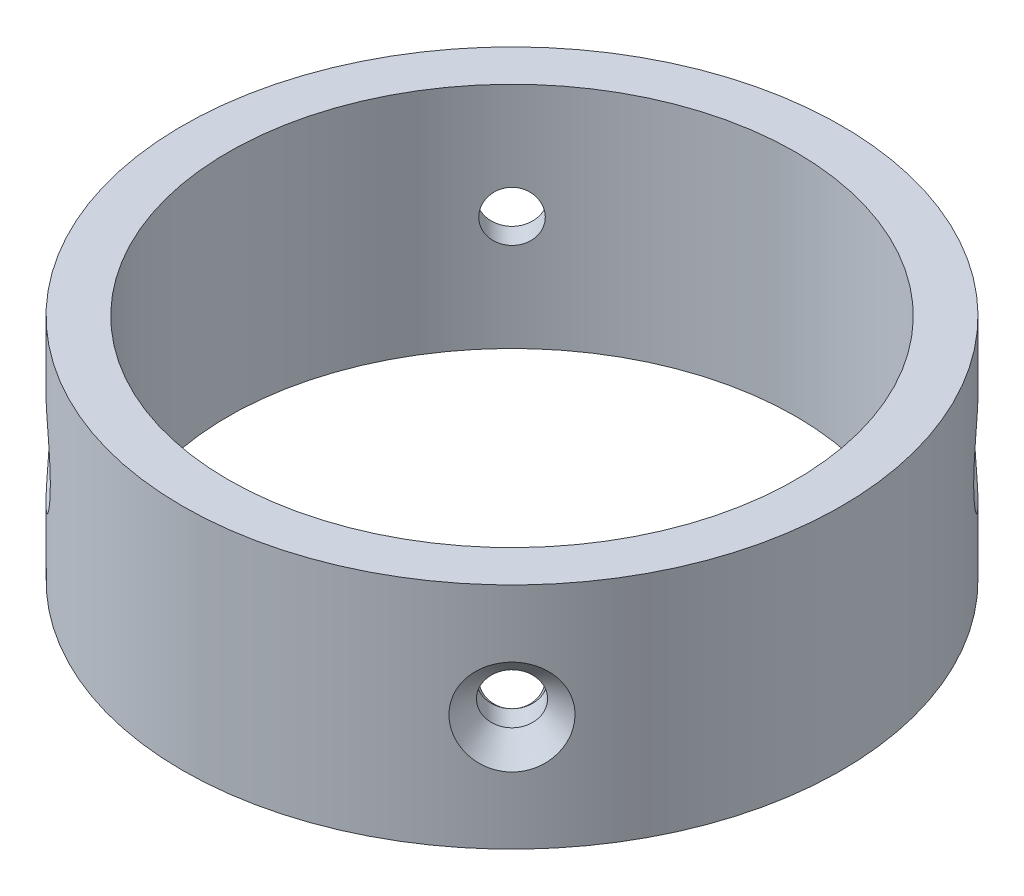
ISO-10303-21;
HEADER;
FILE_DESCRIPTION(('STEP AP214'),'2;1');
FILE_NAME('part.step','',(''),(''),'','','');
FILE_SCHEMA(('AUTOMOTIVE_DESIGN { 1 0 10303 214 1 1 1 1 }'));
ENDSEC;
DATA;
#1=APPLICATION_CONTEXT('core data for automotive mechanical design processes');
#2=APPLICATION_PROTOCOL_DEFINITION('international standard','automotive_design',2000,#1);
#3=PRODUCT_CONTEXT('',#1,'mechanical');
#4=PRODUCT('Part','Part','',(#3));
#5=PRODUCT_RELATED_PRODUCT_CATEGORY('part','',(#4));
#6=PRODUCT_DEFINITION_FORMATION('','',#4);
#7=PRODUCT_DEFINITION_CONTEXT('part definition',#1,'design');
#8=PRODUCT_DEFINITION('design','',#6,#7);
#9=PRODUCT_DEFINITION_SHAPE('','',#8);
#10=(LENGTH_UNIT() NAMED_UNIT(*) SI_UNIT(.MILLI.,.METRE.));
#11=(NAMED_UNIT(*) PLANE_ANGLE_UNIT() SI_UNIT($,.RADIAN.));
#12=(NAMED_UNIT(*) SI_UNIT($,.STERADIAN.) SOLID_ANGLE_UNIT());
#13=UNCERTAINTY_MEASURE_WITH_UNIT(LENGTH_MEASURE(1.E-05),#10,'distance_accuracy_value','');
#14=(GEOMETRIC_REPRESENTATION_CONTEXT(3) GLOBAL_UNCERTAINTY_ASSIGNED_CONTEXT((#13)) GLOBAL_UNIT_ASSIGNED_CONTEXT((#10,
#11,#12)) REPRESENTATION_CONTEXT('',''));
#15=CARTESIAN_POINT('',(0.,0.,0.));
#16=DIRECTION('',(0.,0.,1.));
#17=DIRECTION('',(1.,0.,0.));
#18=AXIS2_PLACEMENT_3D('',#15,#16,#17);
#19=CARTESIAN_POINT('',(0.,25.,0.));
#20=DIRECTION('',(0.,1.,0.));
#21=DIRECTION('',(0.,0.,1.));
#22=AXIS2_PLACEMENT_3D('',#19,#20,#21);
#23=PLANE('',#22);
#24=CARTESIAN_POINT('',(0.,25.,0.));
#25=DIRECTION('',(0.,1.,0.));
#26=DIRECTION('',(0.,0.,1.));
#27=AXIS2_PLACEMENT_3D('',#24,#25,#26);
#28=CIRCLE('',#27,36.);
#29=CARTESIAN_POINT('',(0.,25.,36.));
#30=VERTEX_POINT('',#29);
#31=EDGE_CURVE('E174',#30,#30,#28,.T.);
#32=ORIENTED_EDGE('',*,*,#31,.T.);
#33=EDGE_LOOP('',(#32));
#34=FACE_BOUND('',#33,.T.);
#35=CARTESIAN_POINT('',(0.,25.,0.));
#36=DIRECTION('',(0.,1.,0.));
#37=DIRECTION('',(0.,0.,1.));
#38=AXIS2_PLACEMENT_3D('',#35,#36,#37);
#39=CIRCLE('',#38,31.);
#40=CARTESIAN_POINT('',(0.,25.,31.));
#41=VERTEX_POINT('',#40);
#42=EDGE_CURVE('E178',#41,#41,#39,.T.);
#43=ORIENTED_EDGE('',*,*,#42,.F.);
#44=EDGE_LOOP('',(#43));
#45=FACE_BOUND('',#44,.T.);
#46=ADVANCED_FACE('F34',(#34,#45),#23,.T.);
#47=CARTESIAN_POINT('',(0.,0.,0.));
#48=DIRECTION('',(0.,1.,0.));
#49=DIRECTION('',(0.,0.,1.));
#50=AXIS2_PLACEMENT_3D('',#47,#48,#49);
#51=PLANE('',#50);
#52=CARTESIAN_POINT('',(0.,0.,0.));
#53=DIRECTION('',(0.,1.,0.));
#54=DIRECTION('',(0.,0.,1.));
#55=AXIS2_PLACEMENT_3D('',#52,#53,#54);
#56=CIRCLE('',#55,36.);
#57=CARTESIAN_POINT('',(0.,0.,36.));
#58=VERTEX_POINT('',#57);
#59=EDGE_CURVE('E175',#58,#58,#56,.T.);
#60=ORIENTED_EDGE('',*,*,#59,.F.);
#61=EDGE_LOOP('',(#60));
#62=FACE_BOUND('',#61,.T.);
#63=CARTESIAN_POINT('',(0.,0.,0.));
#64=DIRECTION('',(0.,1.,0.));
#65=DIRECTION('',(0.,0.,1.));
#66=AXIS2_PLACEMENT_3D('',#63,#64,#65);
#67=CIRCLE('',#66,31.);
#68=CARTESIAN_POINT('',(0.,0.,31.));
#69=VERTEX_POINT('',#68);
#70=EDGE_CURVE('E181',#69,#69,#67,.T.);
#71=ORIENTED_EDGE('',*,*,#70,.T.);
#72=EDGE_LOOP('',(#71));
#73=FACE_BOUND('',#72,.T.);
#74=ADVANCED_FACE('F211',(#62,#73),#51,.F.);
#75=CARTESIAN_POINT('',(0.,25.,0.));
#76=DIRECTION('',(0.,-1.,0.));
#77=DIRECTION('',(0.,0.,-1.));
#78=AXIS2_PLACEMENT_3D('',#75,#76,#77);
#79=CYLINDRICAL_SURFACE('',#78,36.);
#80=CARTESIAN_POINT('',(23.1420194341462,8.52445093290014,-27.5762023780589));
#81=CARTESIAN_POINT('',(23.2852155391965,8.35684145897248,-27.456030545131));
#82=CARTESIAN_POINT('',(23.4371563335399,8.2032770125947,-27.3266160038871));
#83=CARTESIAN_POINT('',(23.7547794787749,7.9287049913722,-27.0509638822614));
#84=CARTESIAN_POINT('',(23.9204662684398,7.80770798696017,-26.9047208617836));
#85=CARTESIAN_POINT('',(24.2758945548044,7.59347135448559,-26.5846348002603));
#86=CARTESIAN_POINT('',(24.4664780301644,7.50352789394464,-26.4094990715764));
#87=CARTESIAN_POINT('',(24.8522426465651,7.37087087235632,-26.046804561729));
#88=CARTESIAN_POINT('',(25.047423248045,7.32815179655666,-25.8592472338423));
#89=CARTESIAN_POINT('',(25.4251142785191,7.29289831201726,-25.4878380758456));
#90=CARTESIAN_POINT('',(25.6077348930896,7.29775253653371,-25.3043425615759));
#91=CARTESIAN_POINT('',(25.9657974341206,7.35120099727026,-24.936783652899));
#92=CARTESIAN_POINT('',(26.1412404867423,7.39978834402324,-24.752720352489));
#93=CARTESIAN_POINT('',(26.4780120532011,7.53771342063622,-24.3921091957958));
#94=CARTESIAN_POINT('',(26.6395008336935,7.62648453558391,-24.2154929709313));
#95=CARTESIAN_POINT('',(26.9475538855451,7.84126329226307,-23.8722140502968));
#96=CARTESIAN_POINT('',(27.0941159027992,7.9672765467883,-23.7055528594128));
#97=CARTESIAN_POINT('',(27.3751697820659,8.25788190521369,-23.3805065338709));
#98=CARTESIAN_POINT('',(27.5089680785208,8.42378680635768,-23.2226975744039));
#99=CARTESIAN_POINT('',(27.7558755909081,8.78595136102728,-22.9270267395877));
#100=CARTESIAN_POINT('',(27.868979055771,8.98221942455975,-22.7891704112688));
#101=CARTESIAN_POINT('',(28.0800010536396,9.41321657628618,-22.5287261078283));
#102=CARTESIAN_POINT('',(28.1764526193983,9.64961730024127,-22.407715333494));
#103=CARTESIAN_POINT('',(28.3437938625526,10.1439212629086,-22.1956672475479));
#104=CARTESIAN_POINT('',(28.4146765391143,10.4018303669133,-22.1046381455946));
#105=CARTESIAN_POINT('',(28.5337530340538,10.9476000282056,-21.9507407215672));
#106=CARTESIAN_POINT('',(28.5804251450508,11.2363298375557,-21.8897709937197));
#107=CARTESIAN_POINT('',(28.6444912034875,11.8224427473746,-21.8058689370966));
#108=CARTESIAN_POINT('',(28.6618798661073,12.1198273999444,-21.7829434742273));
#109=CARTESIAN_POINT('',(28.667374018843,12.7242513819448,-21.7757141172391));
#110=CARTESIAN_POINT('',(28.6545900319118,13.0313139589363,-21.792583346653));
#111=CARTESIAN_POINT('',(28.5979277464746,13.6375968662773,-21.8668853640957));
#112=CARTESIAN_POINT('',(28.5540467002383,13.9368165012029,-21.9243217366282));
#113=CARTESIAN_POINT('',(28.4352909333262,14.5193694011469,-22.0781258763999));
#114=CARTESIAN_POINT('',(28.3603527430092,14.8026687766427,-22.1745733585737));
#115=CARTESIAN_POINT('',(28.1799716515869,15.3440109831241,-22.403355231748));
#116=CARTESIAN_POINT('',(28.0745304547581,15.6020552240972,-22.5356876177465));
#117=CARTESIAN_POINT('',(27.8374148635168,16.0776482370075,-22.8278925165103));
#118=CARTESIAN_POINT('',(27.7065246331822,16.2961014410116,-22.9869260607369));
#119=CARTESIAN_POINT('',(27.4185910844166,16.6928288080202,-23.3296111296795));
#120=CARTESIAN_POINT('',(27.2615576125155,16.8711180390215,-23.5132533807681));
#121=CARTESIAN_POINT('',(26.9342820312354,17.1709718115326,-23.8872866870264));
#122=CARTESIAN_POINT('',(26.7653548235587,17.2952500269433,-24.0766501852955));
#123=CARTESIAN_POINT('',(26.4109462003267,17.4962181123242,-24.4648888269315));
#124=CARTESIAN_POINT('',(26.2254732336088,17.5729321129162,-24.6637590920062));
#125=CARTESIAN_POINT('',(25.8561993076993,17.6717448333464,-25.0504212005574));
#126=CARTESIAN_POINT('',(25.6731224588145,17.6971651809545,-25.2380601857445));
#127=CARTESIAN_POINT('',(25.3025652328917,17.7023835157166,-25.6095480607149));
#128=CARTESIAN_POINT('',(25.1150858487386,17.6821916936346,-25.7933977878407));
#129=CARTESIAN_POINT('',(24.7475534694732,17.5984671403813,-26.1461561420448));
#130=CARTESIAN_POINT('',(24.5674547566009,17.5363414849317,-26.3153545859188));
#131=CARTESIAN_POINT('',(24.2138693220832,17.3726689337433,-26.6410654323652));
#132=CARTESIAN_POINT('',(24.0403830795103,17.2711191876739,-26.7975769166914));
#133=CARTESIAN_POINT('',(23.7010107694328,17.0294630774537,-27.0982424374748));
#134=CARTESIAN_POINT('',(23.5353968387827,16.888511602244,-27.2420224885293));
#135=CARTESIAN_POINT('',(23.2208004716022,16.5738822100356,-27.5106761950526));
#136=CARTESIAN_POINT('',(23.0718221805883,16.4001961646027,-27.6355451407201));
#137=CARTESIAN_POINT('',(22.7859583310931,16.0138624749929,-27.8717885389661));
#138=CARTESIAN_POINT('',(22.6503477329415,15.7994945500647,-27.9818913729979));
#139=CARTESIAN_POINT('',(22.4058507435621,15.3459660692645,-28.1780496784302));
#140=CARTESIAN_POINT('',(22.2969721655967,15.10679829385,-28.2640981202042));
#141=CARTESIAN_POINT('',(22.1028782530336,14.5943167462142,-28.416174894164));
#142=CARTESIAN_POINT('',(22.0195787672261,14.319801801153,-28.4806062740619));
#143=CARTESIAN_POINT('',(21.8888023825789,13.7573956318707,-28.5812379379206));
#144=CARTESIAN_POINT('',(21.8413323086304,13.4695018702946,-28.617432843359));
#145=CARTESIAN_POINT('',(21.7824435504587,12.8763717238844,-28.6622859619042));
#146=CARTESIAN_POINT('',(21.7725200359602,12.5708990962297,-28.6698022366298));
#147=CARTESIAN_POINT('',(21.7931806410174,11.9620497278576,-28.6540996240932));
#148=CARTESIAN_POINT('',(21.8237752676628,11.6586735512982,-28.6308727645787));
#149=CARTESIAN_POINT('',(21.9251029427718,11.0592103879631,-28.5533528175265));
#150=CARTESIAN_POINT('',(21.99628157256,10.7632430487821,-28.4987148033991));
#151=CARTESIAN_POINT('',(22.1768513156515,10.1910601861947,-28.3584248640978));
#152=CARTESIAN_POINT('',(22.2862170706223,9.91483170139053,-28.2727935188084));
#153=CARTESIAN_POINT('',(22.5139834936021,9.44369716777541,-28.0915848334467));
#154=CARTESIAN_POINT('',(22.6261285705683,9.24361707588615,-28.0014838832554));
#155=CARTESIAN_POINT('',(22.8700687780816,8.86602958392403,-27.8026022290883));
#156=CARTESIAN_POINT('',(23.0018549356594,8.68851194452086,-27.6938300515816));
#157=CARTESIAN_POINT('',(23.1420194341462,8.52445093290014,-27.5762023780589));
#158=B_SPLINE_CURVE_WITH_KNOTS('',3,(#80,#81,#82,#83,#84,#85,#86,#87,#88,#89,#90,#91,#92,#93,
#94,#95,#96,#97,#98,#99,#100,#101,#102,#103,#104,#105,#106,#107,#108,#109,#110,#111,#112,#113,
#114,#115,#116,#117,#118,#119,#120,#121,#122,#123,#124,#125,#126,#127,#128,#129,#130,#131,#132,
#133,#134,#135,#136,#137,#138,#139,#140,#141,#142,#143,#144,#145,#146,#147,#148,#149,#150,#151,
#152,#153,#154,#155,#156,#157),.UNSPECIFIED.,.T.,.F.,(4,2,2,2,2,2,2,2,2,2,2,2,2,2,2,2,2,2,2,2,2,
2,2,2,2,2,2,2,2,2,2,2,2,2,2,2,2,2,4),(0.,0.752517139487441,1.50527823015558,2.32299575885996,
3.14061778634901,3.91362214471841,4.68650474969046,5.44881327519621,6.21123674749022,
7.00339177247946,7.79576660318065,8.63970104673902,9.48386638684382,10.3760982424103,
11.2684911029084,12.1875183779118,13.106626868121,14.0276230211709,14.9485677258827,
15.8446757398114,16.7404470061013,17.5836799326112,18.426484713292,19.2126927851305,
19.9987252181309,20.7596135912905,21.5205569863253,22.2992724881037,23.0781816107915,
23.9041643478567,24.7303882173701,25.6085077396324,26.4867944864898,27.3997090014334,
28.3128602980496,29.236235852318,30.158999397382,30.8959206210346,31.632506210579),.UNSPECIFIED.);
#159=CARTESIAN_POINT('',(23.1420194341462,8.52445093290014,-27.5762023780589));
#160=VERTEX_POINT('',#159);
#161=EDGE_CURVE('E11',#160,#160,#158,.T.);
#162=ORIENTED_EDGE('',*,*,#161,.T.);
#163=EDGE_LOOP('',(#162));
#164=FACE_BOUND('',#163,.T.);
#165=CARTESIAN_POINT('',(-25.4558441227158,7.30000000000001,-25.4558441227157));
#166=CARTESIAN_POINT('',(-25.2729571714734,7.30001755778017,-25.6387247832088));
#167=CARTESIAN_POINT('',(-25.0879556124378,7.32218637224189,-25.8197472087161));
#168=CARTESIAN_POINT('',(-24.7194611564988,7.40999587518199,-26.1727641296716));
#169=CARTESIAN_POINT('',(-24.5359700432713,7.47568208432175,-26.344748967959));
#170=CARTESIAN_POINT('',(-24.1786820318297,7.64667274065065,-26.6730092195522));
#171=CARTESIAN_POINT('',(-24.004786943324,7.75142369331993,-26.8294671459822));
#172=CARTESIAN_POINT('',(-23.6690147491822,7.99679196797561,-27.1261500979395));
#173=CARTESIAN_POINT('',(-23.5071368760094,8.13740699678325,-27.2663761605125));
#174=CARTESIAN_POINT('',(-23.1923946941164,8.45740054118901,-27.5346625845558));
#175=CARTESIAN_POINT('',(-23.0403187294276,8.63829780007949,-27.6618339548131));
#176=CARTESIAN_POINT('',(-22.7581537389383,9.02890267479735,-27.8944430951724));
#177=CARTESIAN_POINT('',(-22.6280718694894,9.23861962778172,-27.9998737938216));
#178=CARTESIAN_POINT('',(-22.3854930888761,9.69574320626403,-28.1942458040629));
#179=CARTESIAN_POINT('',(-22.2747210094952,9.9447231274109,-28.2816416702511));
#180=CARTESIAN_POINT('',(-22.0850518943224,10.4619475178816,-28.430002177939));
#181=CARTESIAN_POINT('',(-22.0061630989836,10.7301969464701,-28.4909599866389));
#182=CARTESIAN_POINT('',(-21.8791916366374,11.2933850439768,-28.5885955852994));
#183=CARTESIAN_POINT('',(-21.832934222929,11.5889858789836,-28.623838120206));
#184=CARTESIAN_POINT('',(-21.7795142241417,12.1857304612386,-28.6645057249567));
#185=CARTESIAN_POINT('',(-21.7723577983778,12.4868750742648,-28.6699260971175));
#186=CARTESIAN_POINT('',(-21.7976682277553,13.0938086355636,-28.650688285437));
#187=CARTESIAN_POINT('',(-21.8310895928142,13.3995357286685,-28.6253055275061));
#188=CARTESIAN_POINT('',(-21.9381316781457,13.9996026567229,-28.5433508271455));
#189=CARTESIAN_POINT('',(-22.0117552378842,14.2939416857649,-28.4867766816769));
#190=CARTESIAN_POINT('',(-22.1965689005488,14.8615498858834,-28.3430049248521));
#191=CARTESIAN_POINT('',(-22.307630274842,15.1348873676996,-28.2559122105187));
#192=CARTESIAN_POINT('',(-22.5638517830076,15.6529527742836,-28.0517257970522));
#193=CARTESIAN_POINT('',(-22.7090082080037,15.8976838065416,-27.9346353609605));
#194=CARTESIAN_POINT('',(-23.0232052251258,16.3422947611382,-27.6761973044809));
#195=CARTESIAN_POINT('',(-23.1912799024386,16.5434049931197,-27.5357964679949));
#196=CARTESIAN_POINT('',(-23.5491444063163,16.9031721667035,-27.2303676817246));
#197=CARTESIAN_POINT('',(-23.7389247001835,17.0618476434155,-27.0653505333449));
#198=CARTESIAN_POINT('',(-24.1208202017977,17.3213390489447,-26.7254024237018));
#199=CARTESIAN_POINT('',(-24.3120248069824,17.4251850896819,-26.5517629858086));
#200=CARTESIAN_POINT('',(-24.7009371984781,17.5850290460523,-26.1903412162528));
#201=CARTESIAN_POINT('',(-24.8986418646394,17.6410495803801,-26.0025656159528));
#202=CARTESIAN_POINT('',(-25.2810679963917,17.7006785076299,-25.6307280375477));
#203=CARTESIAN_POINT('',(-25.4658172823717,17.7073870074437,-25.4471864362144));
#204=CARTESIAN_POINT('',(-25.8293970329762,17.6762908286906,-25.0780645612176));
#205=CARTESIAN_POINT('',(-26.0082284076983,17.638493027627,-24.8924846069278));
#206=CARTESIAN_POINT('',(-26.3513839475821,17.521262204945,-24.5288773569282));
#207=CARTESIAN_POINT('',(-26.5159343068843,17.4427227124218,-24.3507733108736));
#208=CARTESIAN_POINT('',(-26.8309491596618,17.2475609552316,-24.0032340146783));
#209=CARTESIAN_POINT('',(-26.9814119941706,17.1309342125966,-23.8337997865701));
#210=CARTESIAN_POINT('',(-27.2702265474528,16.859162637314,-23.5028643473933));
#211=CARTESIAN_POINT('',(-27.4080088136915,16.7028654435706,-23.3418145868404));
#212=CARTESIAN_POINT('',(-27.6635643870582,16.3589771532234,-23.0383732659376));
#213=CARTESIAN_POINT('',(-27.7813323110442,16.1713776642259,-22.8959867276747));
#214=CARTESIAN_POINT('',(-28.0024078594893,15.7574269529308,-22.6251562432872));
#215=CARTESIAN_POINT('',(-28.1043150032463,15.529367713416,-22.4981798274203));
#216=CARTESIAN_POINT('',(-28.2831411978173,15.0504208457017,-22.2729580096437));
#217=CARTESIAN_POINT('',(-28.3600532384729,14.7995268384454,-22.1747206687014));
#218=CARTESIAN_POINT('',(-28.4922209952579,14.2659931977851,-22.0046745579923));
#219=CARTESIAN_POINT('',(-28.5459156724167,13.9823529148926,-21.9347863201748));
#220=CARTESIAN_POINT('',(-28.6244097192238,13.4045316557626,-21.8322548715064));
#221=CARTESIAN_POINT('',(-28.6492034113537,13.1103486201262,-21.7996189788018));
#222=CARTESIAN_POINT('',(-28.670121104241,12.5092579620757,-21.7721039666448));
#223=CARTESIAN_POINT('',(-28.6652541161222,12.2022548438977,-21.7785299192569));
#224=CARTESIAN_POINT('',(-28.6245352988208,11.593865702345,-21.8320195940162));
#225=CARTESIAN_POINT('',(-28.5886804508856,11.2924802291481,-21.8790872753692));
#226=CARTESIAN_POINT('',(-28.4858735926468,10.7022901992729,-22.0127716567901));
#227=CARTESIAN_POINT('',(-28.4187517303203,10.4135639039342,-22.0996043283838));
#228=CARTESIAN_POINT('',(-28.2537672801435,9.85920628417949,-22.3101422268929));
#229=CARTESIAN_POINT('',(-28.155906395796,9.59357368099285,-22.4338454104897));
#230=CARTESIAN_POINT('',(-27.9328947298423,9.09990137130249,-22.7108819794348));
#231=CARTESIAN_POINT('',(-27.8084233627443,8.87113756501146,-22.8634684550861));
#232=CARTESIAN_POINT('',(-27.5324944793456,8.45214084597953,-23.1950032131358));
#233=CARTESIAN_POINT('',(-27.3810397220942,8.26190399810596,-23.3739487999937));
#234=CARTESIAN_POINT('',(-27.0626669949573,7.93687810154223,-23.7416857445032));
#235=CARTESIAN_POINT('',(-26.8970471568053,7.79962620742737,-23.9294039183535));
#236=CARTESIAN_POINT('',(-26.6354161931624,7.62933066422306,-24.2192416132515));
#237=CARTESIAN_POINT('',(-26.5460298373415,7.57850418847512,-24.3172052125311));
#238=CARTESIAN_POINT('',(-26.3633836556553,7.48917952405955,-24.5150992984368));
#239=CARTESIAN_POINT('',(-26.2701251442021,7.45067718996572,-24.6150291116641));
#240=CARTESIAN_POINT('',(-26.0591856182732,7.37930581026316,-24.8384254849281));
#241=CARTESIAN_POINT('',(-25.9407016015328,7.34961505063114,-24.962164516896));
#242=CARTESIAN_POINT('',(-25.7004105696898,7.3099567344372,-25.2094961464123));
#243=CARTESIAN_POINT('',(-25.5786037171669,7.29998821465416,-25.3330887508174));
#244=CARTESIAN_POINT('',(-25.4558441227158,7.30000000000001,-25.4558441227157));
#245=B_SPLINE_CURVE_WITH_KNOTS('',3,(#165,#166,#167,#168,#169,#170,#171,#172,#173,#174,#175,
#176,#177,#178,#179,#180,#181,#182,#183,#184,#185,#186,#187,#188,#189,#190,#191,#192,#193,#194,
#195,#196,#197,#198,#199,#200,#201,#202,#203,#204,#205,#206,#207,#208,#209,#210,#211,#212,#213,
#214,#215,#216,#217,#218,#219,#220,#221,#222,#223,#224,#225,#226,#227,#228,#229,#230,#231,#232,
#233,#234,#235,#236,#237,#238,#239,#240,#241,#242,#243,#244),.UNSPECIFIED.,.T.,.F.,(4,2,2,2,2,2,
2,2,2,2,2,2,2,2,2,2,2,2,2,2,2,2,2,2,2,2,2,2,2,2,2,2,2,2,2,2,2,2,2,4),(0.,0.775278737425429,
1.55136972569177,2.31685832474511,3.0822979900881,3.88393774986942,4.68583784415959,
5.54060767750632,6.39559829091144,7.295267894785,8.19507921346,9.11647314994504,
10.0379321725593,10.9562545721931,11.8744771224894,12.7618601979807,13.6488550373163,
14.4796232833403,15.3099984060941,16.0876845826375,16.865250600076,17.626442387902,
18.3877237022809,19.1743317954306,19.9611511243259,20.7981307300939,21.6353448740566,
22.5223786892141,23.4095867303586,24.3265960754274,25.2436947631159,26.1658345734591,
27.0879232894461,27.9888045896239,28.8895938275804,29.7411344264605,30.1666904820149,
30.592103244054,31.1125206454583,31.632912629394),.UNSPECIFIED.);
#246=CARTESIAN_POINT('',(-25.4558441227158,7.30000000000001,-25.4558441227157));
#247=VERTEX_POINT('',#246);
#248=EDGE_CURVE('E86',#247,#247,#245,.T.);
#249=ORIENTED_EDGE('',*,*,#248,.T.);
#250=EDGE_LOOP('',(#249));
#251=FACE_BOUND('',#250,.T.);
#252=CARTESIAN_POINT('',(-27.5762023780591,8.52445093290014,23.1420194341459));
#253=CARTESIAN_POINT('',(-27.6961430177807,8.69174766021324,22.9990976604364));
#254=CARTESIAN_POINT('',(-27.8069291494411,8.87310620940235,22.8648248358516));
#255=CARTESIAN_POINT('',(-28.0090990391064,9.25928436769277,22.6167208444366));
#256=CARTESIAN_POINT('',(-28.1004625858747,9.46412807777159,22.5029109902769));
#257=CARTESIAN_POINT('',(-28.2752774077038,9.92469618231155,22.282983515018));
#258=CARTESIAN_POINT('',(-28.3554839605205,10.1834430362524,22.1805830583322));
#259=CARTESIAN_POINT('',(-28.4886976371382,10.7184128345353,22.0092236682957));
#260=CARTESIAN_POINT('',(-28.5416963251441,10.9946411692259,21.9402751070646));
#261=CARTESIAN_POINT('',(-28.6220194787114,11.5702964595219,21.8353986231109));
#262=CARTESIAN_POINT('',(-28.6480574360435,11.8702065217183,21.8011269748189));
#263=CARTESIAN_POINT('',(-28.6699532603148,12.4730274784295,21.77232422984));
#264=CARTESIAN_POINT('',(-28.6658076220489,12.7759387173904,21.7777977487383));
#265=CARTESIAN_POINT('',(-28.6269720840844,13.38240442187,21.8288232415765));
#266=CARTESIAN_POINT('',(-28.5916870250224,13.6858558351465,21.8751561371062));
#267=CARTESIAN_POINT('',(-28.4899224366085,14.2785879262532,22.0075267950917));
#268=CARTESIAN_POINT('',(-28.4234410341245,14.5678677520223,22.0935669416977));
#269=CARTESIAN_POINT('',(-28.2603346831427,15.1213411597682,22.3018108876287));
#270=CARTESIAN_POINT('',(-28.1639479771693,15.3857122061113,22.4237284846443));
#271=CARTESIAN_POINT('',(-27.9416859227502,15.8833059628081,22.7000772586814));
#272=CARTESIAN_POINT('',(-27.8158152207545,16.1165335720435,22.854503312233));
#273=CARTESIAN_POINT('',(-27.5416229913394,16.5350168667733,23.1841121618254));
#274=CARTESIAN_POINT('',(-27.3943638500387,16.7217844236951,23.3582552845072));
#275=CARTESIAN_POINT('',(-27.0765748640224,17.0513368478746,23.7258910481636));
#276=CARTESIAN_POINT('',(-26.9060561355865,17.1941426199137,23.9193744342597));
#277=CARTESIAN_POINT('',(-26.5576777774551,17.4216061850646,24.3054062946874));
#278=CARTESIAN_POINT('',(-26.3810520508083,17.5094883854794,24.497168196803));
#279=CARTESIAN_POINT('',(-26.0155916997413,17.6374715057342,24.8849310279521));
#280=CARTESIAN_POINT('',(-25.8267624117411,17.6775931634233,25.0809300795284));
#281=CARTESIAN_POINT('',(-25.4540855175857,17.7073040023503,25.4589045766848));
#282=CARTESIAN_POINT('',(-25.2706049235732,17.699744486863,25.6410232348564));
#283=CARTESIAN_POINT('',(-24.9034060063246,17.6410599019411,25.9978054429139));
#284=CARTESIAN_POINT('',(-24.7196877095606,17.5899393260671,26.1724697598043));
#285=CARTESIAN_POINT('',(-24.3597973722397,17.4471306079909,26.5077366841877));
#286=CARTESIAN_POINT('',(-24.1835608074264,17.3559423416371,26.6684842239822));
#287=CARTESIAN_POINT('',(-23.8413466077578,17.1365314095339,26.9748589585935));
#288=CARTESIAN_POINT('',(-23.6753705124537,17.0083032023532,27.120483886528));
#289=CARTESIAN_POINT('',(-23.3517916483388,16.7132465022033,27.3996600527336));
#290=CARTESIAN_POINT('',(-23.1947957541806,16.545070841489,27.5324883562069));
#291=CARTESIAN_POINT('',(-22.9010580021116,16.1785923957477,27.777296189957));
#292=CARTESIAN_POINT('',(-22.764321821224,15.9802811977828,27.8892698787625));
#293=CARTESIAN_POINT('',(-22.5064494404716,15.5452878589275,28.0978481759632));
#294=CARTESIAN_POINT('',(-22.3869148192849,15.3069457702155,28.1929718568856));
#295=CARTESIAN_POINT('',(-22.1781103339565,14.8090842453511,28.3575235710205));
#296=CARTESIAN_POINT('',(-22.0888487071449,14.5495590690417,28.4269446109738));
#297=CARTESIAN_POINT('',(-21.9388928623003,14.0010150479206,28.5428544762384));
#298=CARTESIAN_POINT('',(-21.8800891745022,13.711158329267,28.5878327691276));
#299=CARTESIAN_POINT('',(-21.8006938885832,13.1232495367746,28.6484248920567));
#300=CARTESIAN_POINT('',(-21.7801090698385,12.8251960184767,28.6640335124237));
#301=CARTESIAN_POINT('',(-21.7777407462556,12.2201765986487,28.6658341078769));
#302=CARTESIAN_POINT('',(-21.7970981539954,11.9132025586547,28.6511611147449));
#303=CARTESIAN_POINT('',(-21.8763410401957,11.3076283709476,28.590700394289));
#304=CARTESIAN_POINT('',(-21.9362299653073,11.0090289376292,28.5449100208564));
#305=CARTESIAN_POINT('',(-22.0947645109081,10.4284990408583,28.422374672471));
#306=CARTESIAN_POINT('',(-22.1934580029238,10.1465896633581,28.3455914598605));
#307=CARTESIAN_POINT('',(-22.4264803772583,9.60853800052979,28.1615859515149));
#308=CARTESIAN_POINT('',(-22.5608070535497,9.35239412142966,28.0543655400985));
#309=CARTESIAN_POINT('',(-22.8564769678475,8.88127950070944,27.8139649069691));
#310=CARTESIAN_POINT('',(-23.016960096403,8.66535802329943,27.6815940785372));
#311=CARTESIAN_POINT('',(-23.362117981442,8.2740573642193,27.3909137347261));
#312=CARTESIAN_POINT('',(-23.5467833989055,8.09866260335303,27.2326142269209));
#313=CARTESIAN_POINT('',(-23.9221897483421,7.80482162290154,26.9032964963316));
#314=CARTESIAN_POINT('',(-24.1119175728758,7.68361067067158,26.733593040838));
#315=CARTESIAN_POINT('',(-24.5004216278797,7.48884568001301,26.3779921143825));
#316=CARTESIAN_POINT('',(-24.6991930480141,7.41526661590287,26.19210320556));
#317=CARTESIAN_POINT('',(-25.0853171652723,7.3224139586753,25.8223455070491));
#318=CARTESIAN_POINT('',(-25.2725460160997,7.29984211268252,25.6391707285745));
#319=CARTESIAN_POINT('',(-25.6429104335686,7.30015944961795,25.2687490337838));
#320=CARTESIAN_POINT('',(-25.8260462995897,7.32304529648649,25.0815024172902));
#321=CARTESIAN_POINT('',(-26.1774626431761,7.41188514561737,24.7144322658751));
#322=CARTESIAN_POINT('',(-26.346024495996,7.47652030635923,24.5345550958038));
#323=CARTESIAN_POINT('',(-26.6701615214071,7.6450177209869,24.1818078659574));
#324=CARTESIAN_POINT('',(-26.8257441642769,7.74885721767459,24.0089338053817));
#325=CARTESIAN_POINT('',(-27.0832569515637,7.96094863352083,23.7176073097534));
#326=CARTESIAN_POINT('',(-27.1887631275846,8.06134873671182,23.5965035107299));
#327=CARTESIAN_POINT('',(-27.3899829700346,8.27998341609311,23.3626327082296));
#328=CARTESIAN_POINT('',(-27.4856988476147,8.39821395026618,23.2498638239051));
#329=CARTESIAN_POINT('',(-27.5762023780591,8.52445093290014,23.1420194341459));
#330=B_SPLINE_CURVE_WITH_KNOTS('',3,(#252,#253,#254,#255,#256,#257,#258,#259,#260,#261,#262,
#263,#264,#265,#266,#267,#268,#269,#270,#271,#272,#273,#274,#275,#276,#277,#278,#279,#280,#281,
#282,#283,#284,#285,#286,#287,#288,#289,#290,#291,#292,#293,#294,#295,#296,#297,#298,#299,#300,
#301,#302,#303,#304,#305,#306,#307,#308,#309,#310,#311,#312,#313,#314,#315,#316,#317,#318,#319,
#320,#321,#322,#323,#324,#325,#326,#327,#328,#329),.UNSPECIFIED.,.T.,.F.,(4,2,2,2,2,2,2,2,2,2,2,
2,2,2,2,2,2,2,2,2,2,2,2,2,2,2,2,2,2,2,2,2,2,2,2,2,2,2,4),(0.,0.751259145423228,1.5032962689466,
2.36818583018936,3.23334338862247,4.13810976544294,5.04298121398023,5.96553109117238,
6.88813636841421,7.80357260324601,8.71886466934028,9.59859218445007,10.4779007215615,
11.2989800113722,12.1197026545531,12.8918314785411,13.663880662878,14.4265599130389,
15.1893533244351,15.9828827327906,16.77663407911,17.6222137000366,18.4680232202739,
19.3614354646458,20.2550061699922,21.1744538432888,22.0939797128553,23.0146435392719,
23.9352503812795,24.8301246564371,25.7246543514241,26.5660280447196,27.406959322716,
28.1917357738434,28.9764546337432,29.7375224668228,30.4981491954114,31.0651546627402,
31.632031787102),.UNSPECIFIED.);
#331=CARTESIAN_POINT('',(-27.5762023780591,8.52445093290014,23.1420194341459));
#332=VERTEX_POINT('',#331);
#333=EDGE_CURVE('E135',#332,#332,#330,.T.);
#334=ORIENTED_EDGE('',*,*,#333,.T.);
#335=EDGE_LOOP('',(#334));
#336=FACE_BOUND('',#335,.T.);
#337=CARTESIAN_POINT('',(25.1855430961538,7.31593559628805,25.7233049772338));
#338=CARTESIAN_POINT('',(25.0015130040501,7.33756715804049,25.903482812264));
#339=CARTESIAN_POINT('',(24.8167345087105,7.38122294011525,26.08049416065));
#340=CARTESIAN_POINT('',(24.4514330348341,7.51083943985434,26.4232930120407));
#341=CARTESIAN_POINT('',(24.2709152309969,7.59684907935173,26.5890672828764));
#342=CARTESIAN_POINT('',(23.9206309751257,7.80724361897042,26.9046227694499));
#343=CARTESIAN_POINT('',(23.7508122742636,7.93142121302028,27.0544846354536));
#344=CARTESIAN_POINT('',(23.4256743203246,8.21395075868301,27.3364991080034));
#345=CARTESIAN_POINT('',(23.2703542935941,8.37230088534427,27.4686526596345));
#346=CARTESIAN_POINT('',(22.9700975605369,8.72798291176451,27.7203021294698));
#347=CARTESIAN_POINT('',(22.8262177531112,8.92699224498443,27.8386863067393));
#348=CARTESIAN_POINT('',(22.5629754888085,9.35176717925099,28.0524680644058));
#349=CARTESIAN_POINT('',(22.4436212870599,9.57754174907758,28.1478579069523));
#350=CARTESIAN_POINT('',(22.2256514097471,10.0652186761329,28.3203292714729));
#351=CARTESIAN_POINT('',(22.128891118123,10.3285160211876,28.3958150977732));
#352=CARTESIAN_POINT('',(21.9694464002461,10.8713604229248,28.5193553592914));
#353=CARTESIAN_POINT('',(21.9067699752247,11.1509112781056,28.5674033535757));
#354=CARTESIAN_POINT('',(21.8152147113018,11.7320058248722,28.6373872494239));
#355=CARTESIAN_POINT('',(21.7880106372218,12.0339708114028,28.6580300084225));
#356=CARTESIAN_POINT('',(21.7736408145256,12.6394157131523,28.6689490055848));
#357=CARTESIAN_POINT('',(21.7864804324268,12.9428958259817,28.6592211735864));
#358=CARTESIAN_POINT('',(21.8523727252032,13.5481400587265,28.6090116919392));
#359=CARTESIAN_POINT('',(21.9061023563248,13.8497881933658,28.5680122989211));
#360=CARTESIAN_POINT('',(22.0528980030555,14.4373062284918,28.4548452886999));
#361=CARTESIAN_POINT('',(22.145965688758,14.723175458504,28.3826763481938));
#362=CARTESIAN_POINT('',(22.367322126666,15.2675357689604,28.2085527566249));
#363=CARTESIAN_POINT('',(22.4952367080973,15.5262793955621,28.1069138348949));
#364=CARTESIAN_POINT('',(22.7825938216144,16.0111972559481,27.8744943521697));
#365=CARTESIAN_POINT('',(22.9420304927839,16.2373775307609,27.7437192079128));
#366=CARTESIAN_POINT('',(23.2797663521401,16.6401071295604,27.4608602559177));
#367=CARTESIAN_POINT('',(23.4569954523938,16.8183387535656,27.3098987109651));
#368=CARTESIAN_POINT('',(23.8294117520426,17.1300459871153,26.9855494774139));
#369=CARTESIAN_POINT('',(24.024590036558,17.2635436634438,26.8121729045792));
#370=CARTESIAN_POINT('',(24.4122320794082,17.4724590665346,26.4595325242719));
#371=CARTESIAN_POINT('',(24.603991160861,17.5511866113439,26.2814543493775));
#372=CARTESIAN_POINT('',(24.9904866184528,17.6609976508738,25.9142138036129));
#373=CARTESIAN_POINT('',(25.1852217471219,17.6921005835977,25.72505598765));
#374=CARTESIAN_POINT('',(25.5602379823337,17.7048807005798,25.3523219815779));
#375=CARTESIAN_POINT('',(25.7407159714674,17.6892396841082,25.1690303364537));
#376=CARTESIAN_POINT('',(26.0933793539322,17.6149609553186,24.8032275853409));
#377=CARTESIAN_POINT('',(26.2655653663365,17.5563264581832,24.6207164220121));
#378=CARTESIAN_POINT('',(26.5961517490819,17.3989960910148,24.2632161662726));
#379=CARTESIAN_POINT('',(26.7546393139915,17.3005804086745,24.0881837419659));
#380=CARTESIAN_POINT('',(27.0559183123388,17.0673201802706,23.7492899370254));
#381=CARTESIAN_POINT('',(27.1987071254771,16.9324695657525,23.5854304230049));
#382=CARTESIAN_POINT('',(27.4721648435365,16.6240948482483,23.2664195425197));
#383=CARTESIAN_POINT('',(27.6020237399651,16.4491298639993,23.1119688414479));
#384=CARTESIAN_POINT('',(27.8404171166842,16.0697681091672,22.8242451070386));
#385=CARTESIAN_POINT('',(27.9489455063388,15.8653629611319,22.690978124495));
#386=CARTESIAN_POINT('',(28.1500547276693,15.4185048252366,22.4410757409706));
#387=CARTESIAN_POINT('',(28.2411170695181,15.1744335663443,22.3261108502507));
#388=CARTESIAN_POINT('',(28.3971504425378,14.6661149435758,22.1273103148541));
#389=CARTESIAN_POINT('',(28.462114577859,14.4018622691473,22.0434828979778));
#390=CARTESIAN_POINT('',(28.5683873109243,13.8453093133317,21.9055999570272));
#391=CARTESIAN_POINT('',(28.6082229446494,13.5522651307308,21.8534043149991));
#392=CARTESIAN_POINT('',(28.6582816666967,12.9593773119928,21.7877167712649));
#393=CARTESIAN_POINT('',(28.6684996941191,12.659532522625,21.7742314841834));
#394=CARTESIAN_POINT('',(28.6591473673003,12.0531859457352,21.7865408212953));
#395=CARTESIAN_POINT('',(28.6387863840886,11.7467165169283,21.8133780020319));
#396=CARTESIAN_POINT('',(28.5669013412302,11.1437527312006,21.9074327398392));
#397=CARTESIAN_POINT('',(28.5153749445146,10.8472591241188,21.9746533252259));
#398=CARTESIAN_POINT('',(28.3815190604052,10.2732812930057,22.1472624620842));
#399=CARTESIAN_POINT('',(28.2992268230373,9.99577455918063,22.2526048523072));
#400=CARTESIAN_POINT('',(28.1044230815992,9.46805782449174,22.4981300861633));
#401=CARTESIAN_POINT('',(27.9919150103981,9.21784472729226,22.6383089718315));
#402=CARTESIAN_POINT('',(27.7418255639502,8.76060214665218,22.9440363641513));
#403=CARTESIAN_POINT('',(27.6051304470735,8.55247367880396,23.1086627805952));
#404=CARTESIAN_POINT('',(27.3064432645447,8.17775354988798,23.4608451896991));
#405=CARTESIAN_POINT('',(27.1444559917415,8.01115403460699,23.6483968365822));
#406=CARTESIAN_POINT('',(26.8091937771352,7.73541482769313,24.0276341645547));
#407=CARTESIAN_POINT('',(26.6372161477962,7.62338282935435,24.2183645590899));
#408=CARTESIAN_POINT('',(26.2782637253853,7.44727313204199,24.6073662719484));
#409=CARTESIAN_POINT('',(26.0913144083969,7.38311581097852,24.8056244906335));
#410=CARTESIAN_POINT('',(25.7832298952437,7.3207350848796,25.1247573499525));
#411=CARTESIAN_POINT('',(25.664998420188,7.30652901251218,25.2455249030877));
#412=CARTESIAN_POINT('',(25.4264660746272,7.29704073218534,25.485750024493));
#413=CARTESIAN_POINT('',(25.30616534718,7.30175722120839,25.6052076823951));
#414=CARTESIAN_POINT('',(25.1855430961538,7.31593559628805,25.7233049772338));
#415=B_SPLINE_CURVE_WITH_KNOTS('',3,(#337,#338,#339,#340,#341,#342,#343,#344,#345,#346,#347,
#348,#349,#350,#351,#352,#353,#354,#355,#356,#357,#358,#359,#360,#361,#362,#363,#364,#365,#366,
#367,#368,#369,#370,#371,#372,#373,#374,#375,#376,#377,#378,#379,#380,#381,#382,#383,#384,#385,
#386,#387,#388,#389,#390,#391,#392,#393,#394,#395,#396,#397,#398,#399,#400,#401,#402,#403,#404,
#405,#406,#407,#408,#409,#410,#411,#412,#413,#414),.UNSPECIFIED.,.T.,.F.,(4,2,2,2,2,2,2,2,2,2,2,
2,2,2,2,2,2,2,2,2,2,2,2,2,2,2,2,2,2,2,2,2,2,2,2,2,2,2,4),(0.,0.774730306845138,1.55035759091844,
2.32184441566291,3.09329005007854,3.90761233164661,4.72220826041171,5.58982274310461,
6.45764081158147,7.36510314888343,8.27268710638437,9.19563256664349,10.1186172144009,
11.032057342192,11.9453277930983,12.8203367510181,13.6949134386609,14.5105070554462,
15.3257676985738,16.0951697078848,16.8645141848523,17.6285318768,18.3926768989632,
19.1904533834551,19.9884573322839,20.8389501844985,21.6896676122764,22.5864937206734,
23.4834730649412,24.4040467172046,25.3246894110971,26.2442210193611,27.163648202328,
28.0545483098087,28.9452797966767,29.7815044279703,30.6163351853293,31.1241659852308,
31.6319618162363),.UNSPECIFIED.);
#416=CARTESIAN_POINT('',(25.1855430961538,7.31593559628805,25.7233049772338));
#417=VERTEX_POINT('',#416);
#418=EDGE_CURVE('E146',#417,#417,#415,.T.);
#419=ORIENTED_EDGE('',*,*,#418,.T.);
#420=EDGE_LOOP('',(#419));
#421=FACE_BOUND('',#420,.T.);
#422=ORIENTED_EDGE('',*,*,#31,.F.);
#423=EDGE_LOOP('',(#422));
#424=FACE_BOUND('',#423,.T.);
#425=ORIENTED_EDGE('',*,*,#59,.T.);
#426=EDGE_LOOP('',(#425));
#427=FACE_BOUND('',#426,.T.);
#428=ADVANCED_FACE('F36',(#164,#251,#336,#421,#424,#427),#79,.T.);
#429=CARTESIAN_POINT('',(0.,25.,0.));
#430=DIRECTION('',(0.,-1.,0.));
#431=DIRECTION('',(0.,0.,-1.));
#432=AXIS2_PLACEMENT_3D('',#429,#430,#431);
#433=CYLINDRICAL_SURFACE('',#432,31.);
#434=CARTESIAN_POINT('',(20.7160431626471,10.3999401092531,-23.0617769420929));
#435=CARTESIAN_POINT('',(20.7832573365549,10.3184268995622,-23.0013991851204));
#436=CARTESIAN_POINT('',(20.8544041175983,10.2431787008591,-22.9369570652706));
#437=CARTESIAN_POINT('',(21.0032153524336,10.1070154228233,-22.8007701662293));
#438=CARTESIAN_POINT('',(21.0808817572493,10.0461046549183,-22.7290231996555));
#439=CARTESIAN_POINT('',(21.2560163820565,9.9304945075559,-22.565429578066));
#440=CARTESIAN_POINT('',(21.3544841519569,9.8790470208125,-22.4723241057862));
#441=CARTESIAN_POINT('',(21.5551718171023,9.80095797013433,-22.2798984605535));
#442=CARTESIAN_POINT('',(21.6573922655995,9.77432007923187,-22.1805773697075));
#443=CARTESIAN_POINT('',(21.856914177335,9.7477725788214,-21.9839467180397));
#444=CARTESIAN_POINT('',(21.9541993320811,9.7465634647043,-21.8867948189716));
#445=CARTESIAN_POINT('',(22.1461801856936,9.76761795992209,-21.692518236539));
#446=CARTESIAN_POINT('',(22.2408764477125,9.78987642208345,-21.5953935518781));
#447=CARTESIAN_POINT('',(22.4235198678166,9.85636166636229,-21.4056727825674));
#448=CARTESIAN_POINT('',(22.5115534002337,9.90021490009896,-21.3130281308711));
#449=CARTESIAN_POINT('',(22.6805092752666,10.008039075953,-21.1331433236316));
#450=CARTESIAN_POINT('',(22.7614307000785,10.072012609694,-21.0459038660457));
#451=CARTESIAN_POINT('',(22.9170651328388,10.2203035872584,-20.8763459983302));
#452=CARTESIAN_POINT('',(22.9914836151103,10.3052248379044,-20.7942863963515));
#453=CARTESIAN_POINT('',(23.129684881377,10.4914380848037,-20.6404552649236));
#454=CARTESIAN_POINT('',(23.1934649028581,10.5927343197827,-20.5686864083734));
#455=CARTESIAN_POINT('',(23.3130944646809,10.8155190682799,-20.4330204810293));
#456=CARTESIAN_POINT('',(23.3682045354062,10.9378713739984,-20.3698901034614));
#457=CARTESIAN_POINT('',(23.4647020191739,11.1942531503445,-20.2586572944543));
#458=CARTESIAN_POINT('',(23.5060855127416,11.3282859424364,-20.2105591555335));
#459=CARTESIAN_POINT('',(23.5767802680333,11.6129679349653,-20.1280546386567));
#460=CARTESIAN_POINT('',(23.6052029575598,11.7641319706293,-20.0946603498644));
#461=CARTESIAN_POINT('',(23.6458142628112,12.0715611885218,-20.0468564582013));
#462=CARTESIAN_POINT('',(23.657999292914,12.2278274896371,-20.0324510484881));
#463=CARTESIAN_POINT('',(23.6661641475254,12.547236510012,-20.0228052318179));
#464=CARTESIAN_POINT('',(23.6615220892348,12.7104181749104,-20.0283002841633));
#465=CARTESIAN_POINT('',(23.6346784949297,13.0333141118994,-20.0599699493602));
#466=CARTESIAN_POINT('',(23.6124750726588,13.1930280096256,-20.08614678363));
#467=CARTESIAN_POINT('',(23.5505801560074,13.5051866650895,-20.1586817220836));
#468=CARTESIAN_POINT('',(23.5108010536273,13.6575907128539,-20.2051409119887));
#469=CARTESIAN_POINT('',(23.4142059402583,13.9495449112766,-20.3169977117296));
#470=CARTESIAN_POINT('',(23.357391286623,14.0890960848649,-20.3823938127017));
#471=CARTESIAN_POINT('',(23.2294980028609,14.3466807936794,-20.5280175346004));
#472=CARTESIAN_POINT('',(23.158893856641,14.4652308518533,-20.6077462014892));
#473=CARTESIAN_POINT('',(23.0036846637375,14.6813768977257,-20.7808554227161));
#474=CARTESIAN_POINT('',(22.9190850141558,14.7789809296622,-20.8742307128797));
#475=CARTESIAN_POINT('',(22.7433031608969,14.943993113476,-21.0655639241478));
#476=CARTESIAN_POINT('',(22.6528279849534,15.0128699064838,-21.1629036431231));
#477=CARTESIAN_POINT('',(22.4635094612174,15.12557518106,-21.3637479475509));
#478=CARTESIAN_POINT('',(22.3646702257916,15.1694158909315,-21.4672494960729));
#479=CARTESIAN_POINT('',(22.1682908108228,15.2280221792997,-21.6699209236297));
#480=CARTESIAN_POINT('',(22.0710941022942,15.2445130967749,-21.7689269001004));
#481=CARTESIAN_POINT('',(21.8748352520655,15.2531667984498,-21.9661310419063));
#482=CARTESIAN_POINT('',(21.7757735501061,15.2453352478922,-22.0643293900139));
#483=CARTESIAN_POINT('',(21.5820666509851,15.2063521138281,-22.2538126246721));
#484=CARTESIAN_POINT('',(21.4873829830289,15.1759717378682,-22.3452185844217));
#485=CARTESIAN_POINT('',(21.3018311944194,15.0939965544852,-22.5221765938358));
#486=CARTESIAN_POINT('',(21.2109632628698,15.0424006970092,-22.6077283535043));
#487=CARTESIAN_POINT('',(21.0338796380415,14.9187282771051,-22.7725895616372));
#488=CARTESIAN_POINT('',(20.9477833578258,14.8462852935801,-22.851751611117));
#489=CARTESIAN_POINT('',(20.7843751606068,14.6838066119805,-23.0004778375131));
#490=CARTESIAN_POINT('',(20.7070652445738,14.5937669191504,-23.0700398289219));
#491=CARTESIAN_POINT('',(20.5590250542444,14.3933053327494,-23.2020880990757));
#492=CARTESIAN_POINT('',(20.488911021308,14.2820208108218,-23.2639547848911));
#493=CARTESIAN_POINT('',(20.3622658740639,14.0461484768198,-23.3748846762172));
#494=CARTESIAN_POINT('',(20.3057387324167,13.9215567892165,-23.4239441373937));
#495=CARTESIAN_POINT('',(20.2043973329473,13.6540259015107,-23.5114252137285));
#496=CARTESIAN_POINT('',(20.1605702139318,13.5104220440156,-23.5489597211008));
#497=CARTESIAN_POINT('',(20.0908363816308,13.2158332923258,-23.6084815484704));
#498=CARTESIAN_POINT('',(20.0649337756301,13.0648467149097,-23.6304653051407));
#499=CARTESIAN_POINT('',(20.0308999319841,12.7523350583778,-23.6593234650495));
#500=CARTESIAN_POINT('',(20.0236434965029,12.590645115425,-23.6654541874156));
#501=CARTESIAN_POINT('',(20.0296141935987,12.2678819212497,-23.6604007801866));
#502=CARTESIAN_POINT('',(20.042846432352,12.1068088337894,-23.6492123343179));
#503=CARTESIAN_POINT('',(20.0898283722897,11.7872733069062,-23.6093150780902));
#504=CARTESIAN_POINT('',(20.1238960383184,11.6288912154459,-23.5803347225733));
#505=CARTESIAN_POINT('',(20.2119124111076,11.3221337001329,-23.504934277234));
#506=CARTESIAN_POINT('',(20.2658517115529,11.1737535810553,-23.4585224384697));
#507=CARTESIAN_POINT('',(20.3815774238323,10.9151592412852,-23.3579993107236));
#508=CARTESIAN_POINT('',(20.4405832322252,10.8026946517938,-23.3064375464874));
#509=CARTESIAN_POINT('',(20.5700947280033,10.5908421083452,-23.1922107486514));
#510=CARTESIAN_POINT('',(20.6405911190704,10.4914436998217,-23.1295546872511));
#511=CARTESIAN_POINT('',(20.7160431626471,10.3999401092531,-23.0617769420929));
#512=B_SPLINE_CURVE_WITH_KNOTS('',3,(#434,#435,#436,#437,#438,#439,#440,#441,#442,#443,#444,
#445,#446,#447,#448,#449,#450,#451,#452,#453,#454,#455,#456,#457,#458,#459,#460,#461,#462,#463,
#464,#465,#466,#467,#468,#469,#470,#471,#472,#473,#474,#475,#476,#477,#478,#479,#480,#481,#482,
#483,#484,#485,#486,#487,#488,#489,#490,#491,#492,#493,#494,#495,#496,#497,#498,#499,#500,#501,
#502,#503,#504,#505,#506,#507,#508,#509,#510,#511),.UNSPECIFIED.,.T.,.F.,(4,2,2,2,2,2,2,2,2,2,2,
2,2,2,2,2,2,2,2,2,2,2,2,2,2,2,2,2,2,2,2,2,2,2,2,2,2,2,4),(0.,0.364727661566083,
0.729564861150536,1.16212652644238,1.59475222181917,2.00521222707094,2.41558222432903,
2.8190905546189,3.22265088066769,3.63958191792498,4.05662105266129,4.49958527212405,
4.94267586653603,5.41274782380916,5.88292356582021,6.37064993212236,6.85842869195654,
7.34866676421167,7.83886578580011,8.31448566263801,8.78992255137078,9.23662018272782,
9.68309944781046,10.1001618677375,10.5171271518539,10.9204529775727,11.3237987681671,
11.7347191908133,12.145733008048,12.5799073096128,13.0142084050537,13.476441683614,
13.9387808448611,14.4224451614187,14.9062300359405,15.3975887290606,15.8887151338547,
16.2984742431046,16.7079034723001),.UNSPECIFIED.);
#513=CARTESIAN_POINT('',(21.9203102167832,9.75000000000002,-21.9203102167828));
#514=VERTEX_POINT('',#513);
#515=CARTESIAN_POINT('',(21.9203102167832,15.25,-21.9203102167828));
#516=VERTEX_POINT('',#515);
#517=EDGE_CURVE('E46',#514,#516,#512,.T.);
#518=ORIENTED_EDGE('',*,*,#517,.F.);
#519=EDGE_CURVE('E80',#516,#514,#512,.T.);
#520=ORIENTED_EDGE('',*,*,#519,.F.);
#521=EDGE_LOOP('',(#518,#520));
#522=FACE_BOUND('',#521,.T.);
#523=CARTESIAN_POINT('',(-21.920310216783,9.74999999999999,-21.9203102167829));
#524=CARTESIAN_POINT('',(-21.8316598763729,9.7500036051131,-22.0089596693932));
#525=CARTESIAN_POINT('',(-21.7424372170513,9.75987462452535,-22.0970979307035));
#526=CARTESIAN_POINT('',(-21.5650988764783,9.79902272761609,-22.2702021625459));
#527=CARTESIAN_POINT('',(-21.4769841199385,9.82831505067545,-22.3551655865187));
#528=CARTESIAN_POINT('',(-21.2974589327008,9.90828127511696,-22.5263128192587));
#529=CARTESIAN_POINT('',(-21.2063133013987,9.96042151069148,-22.6120913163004));
#530=CARTESIAN_POINT('',(-21.0304104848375,10.0841443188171,-22.7757833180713));
#531=CARTESIAN_POINT('',(-20.9456547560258,10.1557313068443,-22.8536950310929));
#532=CARTESIAN_POINT('',(-20.7814310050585,10.3192259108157,-23.0031510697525));
#533=CARTESIAN_POINT('',(-20.7023150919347,10.4118378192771,-23.0743108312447));
#534=CARTESIAN_POINT('',(-20.5553163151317,10.6126178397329,-23.2053591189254));
#535=CARTESIAN_POINT('',(-20.4874362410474,10.720789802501,-23.2652448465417));
#536=CARTESIAN_POINT('',(-20.36051797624,10.9570393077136,-23.3764174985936));
#537=CARTESIAN_POINT('',(-20.3023284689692,11.0859493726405,-23.4269043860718));
#538=CARTESIAN_POINT('',(-20.2018525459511,11.3543304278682,-23.5136039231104));
#539=CARTESIAN_POINT('',(-20.159570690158,11.4938044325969,-23.549812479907));
#540=CARTESIAN_POINT('',(-20.0899385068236,11.7879555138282,-23.6092483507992));
#541=CARTESIAN_POINT('',(-20.0635882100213,11.9430455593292,-23.6316080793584));
#542=CARTESIAN_POINT('',(-20.0304314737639,12.2567860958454,-23.6597186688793));
#543=CARTESIAN_POINT('',(-20.0236289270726,12.4154372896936,-23.6654662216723));
#544=CARTESIAN_POINT('',(-20.0298394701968,12.7370751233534,-23.660210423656));
#545=CARTESIAN_POINT('',(-20.0434806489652,12.9000417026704,-23.6486761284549));
#546=CARTESIAN_POINT('',(-20.0913916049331,13.2206806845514,-23.607985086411));
#547=CARTESIAN_POINT('',(-20.1256630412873,13.3783526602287,-23.5788269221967));
#548=CARTESIAN_POINT('',(-20.2138518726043,13.6834951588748,-23.5032666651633));
#549=CARTESIAN_POINT('',(-20.2677371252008,13.8309819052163,-23.4568927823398));
#550=CARTESIAN_POINT('',(-20.3936738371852,14.1113332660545,-23.3474837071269));
#551=CARTESIAN_POINT('',(-20.4657228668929,14.2441998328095,-23.2844507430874));
#552=CARTESIAN_POINT('',(-20.6229045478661,14.4860723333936,-23.1453318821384));
#553=CARTESIAN_POINT('',(-20.7074630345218,14.5957726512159,-23.0698069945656));
#554=CARTESIAN_POINT('',(-20.8888640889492,14.7930246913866,-22.9056818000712));
#555=CARTESIAN_POINT('',(-20.9857012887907,14.8805860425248,-22.8170872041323));
#556=CARTESIAN_POINT('',(-21.1818581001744,15.0249670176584,-22.635052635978));
#557=CARTESIAN_POINT('',(-21.2806177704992,15.0834012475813,-22.5422904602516));
#558=CARTESIAN_POINT('',(-21.4828149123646,15.1750295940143,-22.3496779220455));
#559=CARTESIAN_POINT('',(-21.5862502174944,15.208235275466,-22.2498308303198));
#560=CARTESIAN_POINT('',(-21.7877772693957,15.2466406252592,-22.0524695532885));
#561=CARTESIAN_POINT('',(-21.8858006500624,15.2534555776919,-21.9551973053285));
#562=CARTESIAN_POINT('',(-22.0799026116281,15.243269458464,-21.7599824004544));
#563=CARTESIAN_POINT('',(-22.1759815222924,15.2262724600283,-21.6620398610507));
#564=CARTESIAN_POINT('',(-22.3612852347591,15.1698540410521,-21.4706841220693));
#565=CARTESIAN_POINT('',(-22.4506168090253,15.1309569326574,-21.37721855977));
#566=CARTESIAN_POINT('',(-22.6226226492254,15.0326352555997,-21.1951091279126));
#567=CARTESIAN_POINT('',(-22.7052962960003,14.973208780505,-21.1064657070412));
#568=CARTESIAN_POINT('',(-22.864449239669,14.8339874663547,-20.9339708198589));
#569=CARTESIAN_POINT('',(-22.9406899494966,14.7536683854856,-20.8503233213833));
#570=CARTESIAN_POINT('',(-23.0829165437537,14.5761968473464,-20.6927584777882));
#571=CARTESIAN_POINT('',(-23.1488998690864,14.4790402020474,-20.6188435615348));
#572=CARTESIAN_POINT('',(-23.2732855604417,14.2644312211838,-20.4783671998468));
#573=CARTESIAN_POINT('',(-23.3309898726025,14.1461077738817,-20.4125189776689));
#574=CARTESIAN_POINT('',(-23.4330118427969,13.8971590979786,-20.2953198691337));
#575=CARTESIAN_POINT('',(-23.477325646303,13.7665303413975,-20.243973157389));
#576=CARTESIAN_POINT('',(-23.5544191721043,13.4879407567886,-20.1542321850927));
#577=CARTESIAN_POINT('',(-23.5863059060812,13.339407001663,-20.1168468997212));
#578=CARTESIAN_POINT('',(-23.6340885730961,13.036365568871,-20.0606884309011));
#579=CARTESIAN_POINT('',(-23.6499807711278,12.8818565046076,-20.0419195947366));
#580=CARTESIAN_POINT('',(-23.6659372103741,12.5645410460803,-20.0230764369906));
#581=CARTESIAN_POINT('',(-23.6653305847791,12.401652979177,-20.0237944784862));
#582=CARTESIAN_POINT('',(-23.6466285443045,12.0782799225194,-20.0458763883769));
#583=CARTESIAN_POINT('',(-23.6285310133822,11.9177952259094,-20.067242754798));
#584=CARTESIAN_POINT('',(-23.574786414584,11.6023614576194,-20.1303544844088));
#585=CARTESIAN_POINT('',(-23.5389836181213,11.4474748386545,-20.1722806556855));
#586=CARTESIAN_POINT('',(-23.4501655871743,11.1494916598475,-20.2754616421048));
#587=CARTESIAN_POINT('',(-23.3971516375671,11.0063942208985,-20.3367150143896));
#588=CARTESIAN_POINT('',(-23.2762375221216,10.7402407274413,-20.474983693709));
#589=CARTESIAN_POINT('',(-23.2087560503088,10.6167633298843,-20.551552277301));
#590=CARTESIAN_POINT('',(-23.0592806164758,10.3899536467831,-20.7191247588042));
#591=CARTESIAN_POINT('',(-22.9772889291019,10.286618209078,-20.8101263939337));
#592=CARTESIAN_POINT('',(-22.8056744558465,10.109596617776,-20.9980106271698));
#593=CARTESIAN_POINT('',(-22.7167583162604,10.0345506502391,-21.0942572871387));
#594=CARTESIAN_POINT('',(-22.5298644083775,9.90938543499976,-21.2937496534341));
#595=CARTESIAN_POINT('',(-22.4319005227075,9.85922872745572,-21.3969845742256));
#596=CARTESIAN_POINT('',(-22.2644775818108,9.79859171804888,-21.5708662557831));
#597=CARTESIAN_POINT('',(-22.1967386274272,9.78040715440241,-21.6405730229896));
#598=CARTESIAN_POINT('',(-22.0595544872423,9.75611145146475,-21.7803956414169));
#599=CARTESIAN_POINT('',(-21.9901097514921,9.74999716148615,-21.85051138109));
#600=CARTESIAN_POINT('',(-21.920310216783,9.74999999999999,-21.9203102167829));
#601=B_SPLINE_CURVE_WITH_KNOTS('',3,(#523,#524,#525,#526,#527,#528,#529,#530,#531,#532,#533,
#534,#535,#536,#537,#538,#539,#540,#541,#542,#543,#544,#545,#546,#547,#548,#549,#550,#551,#552,
#553,#554,#555,#556,#557,#558,#559,#560,#561,#562,#563,#564,#565,#566,#567,#568,#569,#570,#571,
#572,#573,#574,#575,#576,#577,#578,#579,#580,#581,#582,#583,#584,#585,#586,#587,#588,#589,#590,
#591,#592,#593,#594,#595,#596,#597,#598,#599,#600),.UNSPECIFIED.,.T.,.F.,(4,2,2,2,2,2,2,2,2,2,2,
2,2,2,2,2,2,2,2,2,2,2,2,2,2,2,2,2,2,2,2,2,2,2,2,2,2,2,4),(0.,0.375796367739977,
0.751887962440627,1.15679662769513,1.56179730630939,1.98316504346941,2.40463723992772,
2.85319812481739,3.30188749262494,3.77641442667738,4.25103585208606,4.740540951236,
5.23008542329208,5.71883123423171,6.20751170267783,6.67833868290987,7.1489605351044,
7.58932298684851,8.02948345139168,8.44223316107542,8.85491227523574,9.2581076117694,
9.66134040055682,10.0758759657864,10.4905147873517,10.93018302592,11.3699777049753,
11.8372339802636,12.304599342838,12.7909958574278,13.2774512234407,13.7682634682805,
14.2590390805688,14.7371710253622,15.2152280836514,15.6658873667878,16.1158663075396,
16.4118297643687,16.7077159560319),.UNSPECIFIED.);
#602=CARTESIAN_POINT('',(-21.920310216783,9.75000000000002,-21.9203102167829));
#603=VERTEX_POINT('',#602);
#604=CARTESIAN_POINT('',(-21.920310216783,15.25,-21.9203102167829));
#605=VERTEX_POINT('',#604);
#606=EDGE_CURVE('E134',#603,#605,#601,.T.);
#607=ORIENTED_EDGE('',*,*,#606,.F.);
#608=EDGE_CURVE('E130',#605,#603,#601,.T.);
#609=ORIENTED_EDGE('',*,*,#608,.F.);
#610=EDGE_LOOP('',(#607,#609));
#611=FACE_BOUND('',#610,.T.);
#612=CARTESIAN_POINT('',(-23.0617769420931,10.3999401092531,20.7160431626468));
#613=CARTESIAN_POINT('',(-23.1372162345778,10.5017948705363,20.6320615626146));
#614=CARTESIAN_POINT('',(-23.2063676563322,10.613517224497,20.5541555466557));
#615=CARTESIAN_POINT('',(-23.3308456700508,10.8528552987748,20.4127552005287));
#616=CARTESIAN_POINT('',(-23.3861467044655,10.9804997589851,20.3492875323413));
#617=CARTESIAN_POINT('',(-23.4822605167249,11.2481962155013,20.238301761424));
#618=CARTESIAN_POINT('',(-23.5230223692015,11.3882897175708,20.1908397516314));
#619=CARTESIAN_POINT('',(-23.5893230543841,11.6765802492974,20.1133400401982));
#620=CARTESIAN_POINT('',(-23.6148659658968,11.8247750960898,20.0832976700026));
#621=CARTESIAN_POINT('',(-23.6514300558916,12.1332837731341,20.040227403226));
#622=CARTESIAN_POINT('',(-23.6616357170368,12.2938286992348,20.0281553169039));
#623=CARTESIAN_POINT('',(-23.6648706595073,12.61536286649,20.0243326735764));
#624=CARTESIAN_POINT('',(-23.6578953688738,12.7763522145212,20.0325875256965));
#625=CARTESIAN_POINT('',(-23.6265246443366,13.0974424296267,20.0695773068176));
#626=CARTESIAN_POINT('',(-23.6017947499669,13.2574658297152,20.098705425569));
#627=CARTESIAN_POINT('',(-23.5348047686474,13.5686945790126,20.177105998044));
#628=CARTESIAN_POINT('',(-23.4925446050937,13.7198998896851,20.2263785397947));
#629=CARTESIAN_POINT('',(-23.3917566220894,14.006638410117,20.3428499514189));
#630=CARTESIAN_POINT('',(-23.3334744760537,14.1423676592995,20.4097775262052));
#631=CARTESIAN_POINT('',(-23.2012511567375,14.3960383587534,20.5599589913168));
#632=CARTESIAN_POINT('',(-23.1273139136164,14.5139842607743,20.6432087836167));
#633=CARTESIAN_POINT('',(-22.9691480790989,14.7223283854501,20.8190177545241));
#634=CARTESIAN_POINT('',(-22.8855972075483,14.8137895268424,20.9109249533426));
#635=CARTESIAN_POINT('',(-22.7074482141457,14.9727971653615,21.104241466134));
#636=CARTESIAN_POINT('',(-22.6128555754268,15.0403554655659,21.2056460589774));
#637=CARTESIAN_POINT('',(-22.4219715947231,15.1448051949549,21.4073148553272));
#638=CARTESIAN_POINT('',(-22.3262357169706,15.1834733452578,21.5071854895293));
#639=CARTESIAN_POINT('',(-22.1301342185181,15.2356973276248,21.7089130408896));
#640=CARTESIAN_POINT('',(-22.0297703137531,15.2492623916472,21.8107692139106));
#641=CARTESIAN_POINT('',(-21.8327387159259,15.2506430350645,22.0079522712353));
#642=CARTESIAN_POINT('',(-21.7361448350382,15.2397412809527,22.1033464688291));
#643=CARTESIAN_POINT('',(-21.544445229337,15.1952601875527,22.2902400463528));
#644=CARTESIAN_POINT('',(-21.4493394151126,15.1616822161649,22.3817396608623));
#645=CARTESIAN_POINT('',(-21.2637002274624,15.0733429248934,22.5581785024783));
#646=CARTESIAN_POINT('',(-21.1731522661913,15.0186547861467,22.64313919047));
#647=CARTESIAN_POINT('',(-20.9987371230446,14.8900841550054,22.8049822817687));
#648=CARTESIAN_POINT('',(-20.9148710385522,14.8161985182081,22.8818633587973));
#649=CARTESIAN_POINT('',(-20.7524892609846,14.6480689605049,23.0292584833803));
#650=CARTESIAN_POINT('',(-20.6743630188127,14.5530814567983,23.0993521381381));
#651=CARTESIAN_POINT('',(-20.5296350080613,14.3478096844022,23.2280754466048));
#652=CARTESIAN_POINT('',(-20.4630364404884,14.2375211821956,23.2867019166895));
#653=CARTESIAN_POINT('',(-20.3390102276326,13.9971649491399,23.3951255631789));
#654=CARTESIAN_POINT('',(-20.2824538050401,13.8662794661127,23.4441069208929));
#655=CARTESIAN_POINT('',(-20.1855110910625,13.5943139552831,23.5276273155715));
#656=CARTESIAN_POINT('',(-20.1451292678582,13.4532311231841,23.5621623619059));
#657=CARTESIAN_POINT('',(-20.0796766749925,13.1563556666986,23.6179711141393));
#658=CARTESIAN_POINT('',(-20.0555977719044,13.000182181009,23.6383871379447));
#659=CARTESIAN_POINT('',(-20.0271385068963,12.6847716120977,23.6625034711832));
#660=CARTESIAN_POINT('',(-20.022761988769,12.5255339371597,23.6662005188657));
#661=CARTESIAN_POINT('',(-20.0339873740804,12.203548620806,23.6566991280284));
#662=CARTESIAN_POINT('',(-20.0501813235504,12.0408356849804,23.6430000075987));
#663=CARTESIAN_POINT('',(-20.1031534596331,11.7212800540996,23.5979748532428));
#664=CARTESIAN_POINT('',(-20.1399330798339,11.5644377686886,23.5666475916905));
#665=CARTESIAN_POINT('',(-20.2329187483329,11.2618671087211,23.4868627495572));
#666=CARTESIAN_POINT('',(-20.2890517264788,11.116099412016,23.4384695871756));
#667=CARTESIAN_POINT('',(-20.4192145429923,10.8397259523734,23.3251600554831));
#668=CARTESIAN_POINT('',(-20.4932417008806,10.7091179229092,23.2602461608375));
#669=CARTESIAN_POINT('',(-20.6537956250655,10.472443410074,23.1177803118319));
#670=CARTESIAN_POINT('',(-20.7397291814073,10.3656238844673,23.0408133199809));
#671=CARTESIAN_POINT('',(-20.9234374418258,10.1744706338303,22.8741139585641));
#672=CARTESIAN_POINT('',(-21.0212068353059,10.0901268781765,22.7843873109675));
#673=CARTESIAN_POINT('',(-21.2185946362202,9.95226530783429,22.6006240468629));
#674=CARTESIAN_POINT('',(-21.3176762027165,9.8970952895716,22.5072505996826));
#675=CARTESIAN_POINT('',(-21.5200568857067,9.81201974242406,22.3138228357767));
#676=CARTESIAN_POINT('',(-21.6233539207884,9.78210189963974,22.2137718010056));
#677=CARTESIAN_POINT('',(-21.8243342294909,9.74991270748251,22.0162911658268));
#678=CARTESIAN_POINT('',(-21.9219761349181,9.7460681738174,21.9190731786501));
#679=CARTESIAN_POINT('',(-22.1150034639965,9.76201925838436,21.7243046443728));
#680=CARTESIAN_POINT('',(-22.2103886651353,9.781817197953,21.6267540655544));
#681=CARTESIAN_POINT('',(-22.3943742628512,9.84360175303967,21.4361665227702));
#682=CARTESIAN_POINT('',(-22.4830703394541,9.88515079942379,21.3430787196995));
#683=CARTESIAN_POINT('',(-22.6534831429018,9.98855484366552,21.1621155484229));
#684=CARTESIAN_POINT('',(-22.7352071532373,10.0503883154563,21.0742347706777));
#685=CARTESIAN_POINT('',(-22.8571313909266,10.1620109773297,20.9417262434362));
#686=CARTESIAN_POINT('',(-22.9002334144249,10.2057729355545,20.8945718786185));
#687=CARTESIAN_POINT('',(-22.9833586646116,10.298818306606,20.8031016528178));
#688=CARTESIAN_POINT('',(-23.0233821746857,10.348101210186,20.7587855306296));
#689=CARTESIAN_POINT('',(-23.0617769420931,10.3999401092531,20.7160431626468));
#690=B_SPLINE_CURVE_WITH_KNOTS('',3,(#612,#613,#614,#615,#616,#617,#618,#619,#620,#621,#622,
#623,#624,#625,#626,#627,#628,#629,#630,#631,#632,#633,#634,#635,#636,#637,#638,#639,#640,#641,
#642,#643,#644,#645,#646,#647,#648,#649,#650,#651,#652,#653,#654,#655,#656,#657,#658,#659,#660,
#661,#662,#663,#664,#665,#666,#667,#668,#669,#670,#671,#672,#673,#674,#675,#676,#677,#678,#679,
#680,#681,#682,#683,#684,#685,#686,#687,#688,#689),.UNSPECIFIED.,.T.,.F.,(4,2,2,2,2,2,2,2,2,2,2,
2,2,2,2,2,2,2,2,2,2,2,2,2,2,2,2,2,2,2,2,2,2,2,2,2,2,2,4),(0.,0.45585303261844,0.912541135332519,
1.37081349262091,1.82896297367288,2.31070453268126,2.79257429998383,3.28376803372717,
3.77496391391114,4.25901198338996,4.74293867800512,5.2032656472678,5.66336499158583,
6.09209691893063,6.52067114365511,6.92730495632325,7.33391424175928,7.73912644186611,
8.14440505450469,8.56724955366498,8.99021128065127,9.44051666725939,9.89094636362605,
10.3667773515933,10.842701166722,11.3326382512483,11.8226094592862,12.3107506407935,
12.7988187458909,13.2680359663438,13.7370434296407,14.1754502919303,14.6136432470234,
15.0251416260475,15.436680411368,15.8402414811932,16.2433756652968,16.4754030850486,
16.7074091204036),.UNSPECIFIED.);
#691=CARTESIAN_POINT('',(-21.920310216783,15.25,21.9203102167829));
#692=VERTEX_POINT('',#691);
#693=CARTESIAN_POINT('',(-21.920310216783,9.75000000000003,21.9203102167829));
#694=VERTEX_POINT('',#693);
#695=EDGE_CURVE('E140',#692,#694,#690,.T.);
#696=ORIENTED_EDGE('',*,*,#695,.F.);
#697=EDGE_CURVE('E141',#694,#692,#690,.T.);
#698=ORIENTED_EDGE('',*,*,#697,.F.);
#699=EDGE_LOOP('',(#696,#698));
#700=FACE_BOUND('',#699,.T.);
#701=CARTESIAN_POINT('',(21.779582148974,9.75822437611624,22.0601408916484));
#702=CARTESIAN_POINT('',(21.6907293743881,9.76859560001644,22.1478628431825));
#703=CARTESIAN_POINT('',(21.6018905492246,9.7887758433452,22.2345029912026));
#704=CARTESIAN_POINT('',(21.4264836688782,9.84807051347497,22.4035862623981));
#705=CARTESIAN_POINT('',(21.3399176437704,9.88720129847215,22.4860256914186));
#706=CARTESIAN_POINT('',(21.1640728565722,9.9871806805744,22.6516624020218));
#707=CARTESIAN_POINT('',(21.0751824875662,10.0495844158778,22.7343356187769));
#708=CARTESIAN_POINT('',(20.9050065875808,10.1929484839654,22.8909175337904));
#709=CARTESIAN_POINT('',(20.8237229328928,10.2739133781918,22.9648240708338));
#710=CARTESIAN_POINT('',(20.6670481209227,10.4561711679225,23.1059469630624));
#711=CARTESIAN_POINT('',(20.5921343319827,10.5582598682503,23.1726646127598));
#712=CARTESIAN_POINT('',(20.4547208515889,10.7769080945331,23.2940512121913));
#713=CARTESIAN_POINT('',(20.3922244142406,10.8934714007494,23.348717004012));
#714=CARTESIAN_POINT('',(20.2774448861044,11.1458923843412,23.448484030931));
#715=CARTESIAN_POINT('',(20.2260936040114,11.2825125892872,23.4927290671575));
#716=CARTESIAN_POINT('',(20.1403427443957,11.5647928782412,23.5662851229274));
#717=CARTESIAN_POINT('',(20.1059477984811,11.7104554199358,23.5955920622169));
#718=CARTESIAN_POINT('',(20.0535808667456,12.0148460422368,23.6401175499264));
#719=CARTESIAN_POINT('',(20.0365630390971,12.1738588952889,23.6545181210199));
#720=CARTESIAN_POINT('',(20.0226315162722,12.4933993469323,23.6663116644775));
#721=CARTESIAN_POINT('',(20.0257212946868,12.6539272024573,23.6637016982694));
#722=CARTESIAN_POINT('',(20.0522448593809,12.975917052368,23.6412307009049));
#723=CARTESIAN_POINT('',(20.076155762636,13.1373121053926,23.6209650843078));
#724=CARTESIAN_POINT('',(20.1443435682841,13.4524807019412,23.5628396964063));
#725=CARTESIAN_POINT('',(20.1886213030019,13.6062539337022,23.5249792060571));
#726=CARTESIAN_POINT('',(20.2957872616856,13.8999516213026,23.432583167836));
#727=CARTESIAN_POINT('',(20.3584819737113,14.0400008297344,23.3782208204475));
#728=CARTESIAN_POINT('',(20.5008729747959,14.3033471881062,23.2534541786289));
#729=CARTESIAN_POINT('',(20.5805657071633,14.4266478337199,23.1830532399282));
#730=CARTESIAN_POINT('',(20.7505908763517,14.6468204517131,23.030965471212));
#731=CARTESIAN_POINT('',(20.8402871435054,14.7446285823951,22.9499251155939));
#732=CARTESIAN_POINT('',(21.0301428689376,14.9168488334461,22.7760750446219));
#733=CARTESIAN_POINT('',(21.1302972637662,14.9912722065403,22.6832710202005));
#734=CARTESIAN_POINT('',(21.3306189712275,15.1092716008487,22.494939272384));
#735=CARTESIAN_POINT('',(21.4303301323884,15.1545891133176,22.4000170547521));
#736=CARTESIAN_POINT('',(21.63262462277,15.2200023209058,22.2047128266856));
#737=CARTESIAN_POINT('',(21.735206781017,15.2401081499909,22.1043330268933));
#738=CARTESIAN_POINT('',(21.9341407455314,15.2537978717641,21.9068944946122));
#739=CARTESIAN_POINT('',(22.0305222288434,15.248792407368,21.8099608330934));
#740=CARTESIAN_POINT('',(22.2200206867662,15.2157003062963,21.6168678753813));
#741=CARTESIAN_POINT('',(22.3131379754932,15.1876158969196,21.5207085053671));
#742=CARTESIAN_POINT('',(22.4926999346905,15.109913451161,21.332959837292));
#743=CARTESIAN_POINT('',(22.5792025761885,15.0605161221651,21.241334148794));
#744=CARTESIAN_POINT('',(22.7445969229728,14.9420720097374,21.0641406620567));
#745=CARTESIAN_POINT('',(22.8234875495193,14.8730224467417,20.9785737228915));
#746=CARTESIAN_POINT('',(22.9750031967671,14.7145801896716,20.8125529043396));
#747=CARTESIAN_POINT('',(23.0472695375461,14.6245060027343,20.7324232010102));
#748=CARTESIAN_POINT('',(23.1807419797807,14.4285248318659,20.5830817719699));
#749=CARTESIAN_POINT('',(23.2419450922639,14.3226135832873,20.5138729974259));
#750=CARTESIAN_POINT('',(23.355983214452,14.0907743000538,20.3839644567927));
#751=CARTESIAN_POINT('',(23.4080370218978,13.9640010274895,20.3240873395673));
#752=CARTESIAN_POINT('',(23.4980506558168,13.699515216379,20.2199496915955));
#753=CARTESIAN_POINT('',(23.5360065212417,13.5617996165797,20.1756935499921));
#754=CARTESIAN_POINT('',(23.5992373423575,13.2706680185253,20.1017045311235));
#755=CARTESIAN_POINT('',(23.6236358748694,13.1168049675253,20.0729781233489));
#756=CARTESIAN_POINT('',(23.6559431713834,12.8049979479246,20.0348939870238));
#757=CARTESIAN_POINT('',(23.663848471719,12.6470531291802,20.0255403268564));
#758=CARTESIAN_POINT('',(23.6630754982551,12.3259673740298,20.0264542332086));
#759=CARTESIAN_POINT('',(23.6538350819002,12.1628289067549,20.0373869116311));
#760=CARTESIAN_POINT('',(23.6177445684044,11.8412373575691,20.0799130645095));
#761=CARTESIAN_POINT('',(23.5908929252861,11.6827846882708,20.1115083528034));
#762=CARTESIAN_POINT('',(23.5198443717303,11.3751071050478,20.1945511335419));
#763=CARTESIAN_POINT('',(23.4756369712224,11.2258878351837,20.2460106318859));
#764=CARTESIAN_POINT('',(23.3704257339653,10.9414946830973,20.3673665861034));
#765=CARTESIAN_POINT('',(23.3094242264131,10.8063188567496,20.4372604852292));
#766=CARTESIAN_POINT('',(23.1739532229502,10.5590867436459,20.5907255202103));
#767=CARTESIAN_POINT('',(23.100018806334,10.4463954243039,20.6737438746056));
#768=CARTESIAN_POINT('',(22.9387399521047,10.2427598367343,20.8525452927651));
#769=CARTESIAN_POINT('',(22.851398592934,10.1518105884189,20.948325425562));
#770=CARTESIAN_POINT('',(22.6712701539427,10.0004952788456,21.1430834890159));
#771=CARTESIAN_POINT('',(22.5791690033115,9.93856789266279,21.2414833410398));
#772=CARTESIAN_POINT('',(22.3875025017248,9.83998491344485,21.4433904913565));
#773=CARTESIAN_POINT('',(22.2879482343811,9.80329258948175,21.5468901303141));
#774=CARTESIAN_POINT('',(22.1196977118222,9.76482306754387,21.7193027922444));
#775=CARTESIAN_POINT('',(22.0522370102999,9.7553593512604,21.7877978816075));
#776=CARTESIAN_POINT('',(21.9163753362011,9.74806999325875,21.9244558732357));
#777=CARTESIAN_POINT('',(21.8479746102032,9.7502413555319,21.9926188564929));
#778=CARTESIAN_POINT('',(21.779582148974,9.75822437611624,22.0601408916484));
#779=B_SPLINE_CURVE_WITH_KNOTS('',3,(#701,#702,#703,#704,#705,#706,#707,#708,#709,#710,#711,
#712,#713,#714,#715,#716,#717,#718,#719,#720,#721,#722,#723,#724,#725,#726,#727,#728,#729,#730,
#731,#732,#733,#734,#735,#736,#737,#738,#739,#740,#741,#742,#743,#744,#745,#746,#747,#748,#749,
#750,#751,#752,#753,#754,#755,#756,#757,#758,#759,#760,#761,#762,#763,#764,#765,#766,#767,#768,
#769,#770,#771,#772,#773,#774,#775,#776,#777,#778),.UNSPECIFIED.,.T.,.F.,(4,2,2,2,2,2,2,2,2,2,2,
2,2,2,2,2,2,2,2,2,2,2,2,2,2,2,2,2,2,2,2,2,2,2,2,2,2,2,4),(0.,0.375564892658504,
0.751454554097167,1.15909163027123,1.56682899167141,1.9943529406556,2.42198877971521,
2.87751168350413,3.3331589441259,3.81266289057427,4.29224967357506,4.78312429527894,
5.27401897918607,5.75992972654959,6.24573890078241,6.70979572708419,7.17362890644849,
7.60618931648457,8.03857580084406,8.44695404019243,8.85529287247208,9.25950096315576,
9.66376625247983,10.0836127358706,10.503572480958,10.9502787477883,11.39711042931,
11.8702042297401,12.3433973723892,12.83237946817,13.3214044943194,13.810725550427,
14.2999787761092,14.7724129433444,15.2447387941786,15.6874176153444,16.1294507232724,
16.4186079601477,16.7076907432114),.UNSPECIFIED.);
#780=CARTESIAN_POINT('',(21.920310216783,15.25,21.9203102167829));
#781=VERTEX_POINT('',#780);
#782=CARTESIAN_POINT('',(21.920310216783,9.74999999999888,21.9203102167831));
#783=VERTEX_POINT('',#782);
#784=EDGE_CURVE('E173',#781,#783,#779,.T.);
#785=ORIENTED_EDGE('',*,*,#784,.F.);
#786=EDGE_CURVE('E169',#783,#781,#779,.T.);
#787=ORIENTED_EDGE('',*,*,#786,.F.);
#788=EDGE_LOOP('',(#785,#787));
#789=FACE_BOUND('',#788,.T.);
#790=ORIENTED_EDGE('',*,*,#42,.T.);
#791=EDGE_LOOP('',(#790));
#792=FACE_BOUND('',#791,.T.);
#793=ORIENTED_EDGE('',*,*,#70,.F.);
#794=EDGE_LOOP('',(#793));
#795=FACE_BOUND('',#794,.T.);
#796=ADVANCED_FACE('F94',(#522,#611,#700,#789,#792,#795),#433,.F.);
#797=CARTESIAN_POINT('',(25.4558441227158,12.5,25.4558441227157));
#798=DIRECTION('',(0.707106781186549,0.,0.707106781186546));
#799=DIRECTION('',(0.707106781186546,0.,-0.707106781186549));
#800=AXIS2_PLACEMENT_3D('',#797,#798,#799);
#801=CONICAL_SURFACE('',#800,5.2,0.785398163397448);
#802=CARTESIAN_POINT('',(23.7234325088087,12.5,23.7234325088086));
#803=DIRECTION('',(0.707106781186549,0.,0.707106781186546));
#804=DIRECTION('',(0.707106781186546,0.,-0.707106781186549));
#805=AXIS2_PLACEMENT_3D('',#802,#803,#804);
#806=CIRCLE('',#805,2.75);
#807=CARTESIAN_POINT('',(25.6679761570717,12.5,21.7788888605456));
#808=VERTEX_POINT('',#807);
#809=EDGE_CURVE('E189',#808,#808,#806,.T.);
#810=ORIENTED_EDGE('',*,*,#809,.F.);
#811=EDGE_LOOP('',(#810));
#812=FACE_BOUND('',#811,.T.);
#813=ORIENTED_EDGE('',*,*,#418,.F.);
#814=EDGE_LOOP('',(#813));
#815=FACE_BOUND('',#814,.T.);
#816=ADVANCED_FACE('F156',(#812,#815),#801,.F.);
#817=CARTESIAN_POINT('',(21.920310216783,12.5,21.9203102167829));
#818=DIRECTION('',(0.707106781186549,0.,0.707106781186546));
#819=DIRECTION('',(0.707106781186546,0.,-0.707106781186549));
#820=AXIS2_PLACEMENT_3D('',#817,#818,#819);
#821=CONICAL_SURFACE('',#820,2.74999999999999,1.02974425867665);
#822=ORIENTED_EDGE('',*,*,#784,.T.);
#823=CARTESIAN_POINT('',(21.920310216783,12.5,21.9203102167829));
#824=DIRECTION('',(0.707106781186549,0.,0.707106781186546));
#825=DIRECTION('',(0.707106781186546,0.,-0.707106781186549));
#826=AXIS2_PLACEMENT_3D('',#823,#824,#825);
#827=CIRCLE('',#826,2.74999999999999);
#828=EDGE_CURVE('E188',#783,#781,#827,.T.);
#829=ORIENTED_EDGE('',*,*,#828,.T.);
#830=EDGE_LOOP('',(#822,#829));
#831=FACE_BOUND('',#830,.T.);
#832=ADVANCED_FACE('F160',(#831),#821,.F.);
#833=ORIENTED_EDGE('',*,*,#786,.T.);
#834=EDGE_CURVE('E184',#781,#783,#827,.T.);
#835=ORIENTED_EDGE('',*,*,#834,.T.);
#836=EDGE_LOOP('',(#833,#835));
#837=FACE_BOUND('',#836,.T.);
#838=ADVANCED_FACE('F164',(#837),#821,.F.);
#839=CARTESIAN_POINT('',(25.4558441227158,12.5,25.4558441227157));
#840=DIRECTION('',(0.707106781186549,0.,0.707106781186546));
#841=DIRECTION('',(0.707106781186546,0.,-0.707106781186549));
#842=AXIS2_PLACEMENT_3D('',#839,#840,#841);
#843=CYLINDRICAL_SURFACE('',#842,2.74999999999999);
#844=ORIENTED_EDGE('',*,*,#834,.F.);
#845=ORIENTED_EDGE('',*,*,#828,.F.);
#846=EDGE_LOOP('',(#844,#845));
#847=FACE_BOUND('',#846,.T.);
#848=ORIENTED_EDGE('',*,*,#809,.T.);
#849=EDGE_LOOP('',(#848));
#850=FACE_BOUND('',#849,.T.);
#851=ADVANCED_FACE('F162',(#847,#850),#843,.F.);
#852=CARTESIAN_POINT('',(-25.4558441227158,12.5,25.4558441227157));
#853=DIRECTION('',(-0.707106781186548,0.,0.707106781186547));
#854=DIRECTION('',(0.707106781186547,0.,0.707106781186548));
#855=AXIS2_PLACEMENT_3D('',#852,#853,#854);
#856=CONICAL_SURFACE('',#855,5.2,0.785398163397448);
#857=CARTESIAN_POINT('',(-23.7234325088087,12.5,23.7234325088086));
#858=DIRECTION('',(-0.707106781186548,0.,0.707106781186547));
#859=DIRECTION('',(0.707106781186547,0.,0.707106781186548));
#860=AXIS2_PLACEMENT_3D('',#857,#858,#859);
#861=CIRCLE('',#860,2.75);
#862=CARTESIAN_POINT('',(-21.7788888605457,12.5,25.6679761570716));
#863=VERTEX_POINT('',#862);
#864=EDGE_CURVE('E195',#863,#863,#861,.T.);
#865=ORIENTED_EDGE('',*,*,#864,.F.);
#866=EDGE_LOOP('',(#865));
#867=FACE_BOUND('',#866,.T.);
#868=ORIENTED_EDGE('',*,*,#333,.F.);
#869=EDGE_LOOP('',(#868));
#870=FACE_BOUND('',#869,.T.);
#871=ADVANCED_FACE('F127',(#867,#870),#856,.F.);
#872=CARTESIAN_POINT('',(-21.920310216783,12.5,21.9203102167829));
#873=DIRECTION('',(-0.707106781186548,0.,0.707106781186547));
#874=DIRECTION('',(0.707106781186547,0.,0.707106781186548));
#875=AXIS2_PLACEMENT_3D('',#872,#873,#874);
#876=CONICAL_SURFACE('',#875,2.74999999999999,1.02974425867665);
#877=ORIENTED_EDGE('',*,*,#695,.T.);
#878=CARTESIAN_POINT('',(-21.920310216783,12.5,21.9203102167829));
#879=DIRECTION('',(-0.707106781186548,0.,0.707106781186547));
#880=DIRECTION('',(0.707106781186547,0.,0.707106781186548));
#881=AXIS2_PLACEMENT_3D('',#878,#879,#880);
#882=CIRCLE('',#881,2.74999999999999);
#883=EDGE_CURVE('E194',#694,#692,#882,.T.);
#884=ORIENTED_EDGE('',*,*,#883,.T.);
#885=EDGE_LOOP('',(#877,#884));
#886=FACE_BOUND('',#885,.T.);
#887=ADVANCED_FACE('F154',(#886),#876,.F.);
#888=ORIENTED_EDGE('',*,*,#697,.T.);
#889=EDGE_CURVE('E192',#692,#694,#882,.T.);
#890=ORIENTED_EDGE('',*,*,#889,.T.);
#891=EDGE_LOOP('',(#888,#890));
#892=FACE_BOUND('',#891,.T.);
#893=ADVANCED_FACE('F151',(#892),#876,.F.);
#894=CARTESIAN_POINT('',(-25.4558441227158,12.5,25.4558441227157));
#895=DIRECTION('',(-0.707106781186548,0.,0.707106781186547));
#896=DIRECTION('',(0.707106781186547,0.,0.707106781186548));
#897=AXIS2_PLACEMENT_3D('',#894,#895,#896);
#898=CYLINDRICAL_SURFACE('',#897,2.74999999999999);
#899=ORIENTED_EDGE('',*,*,#889,.F.);
#900=ORIENTED_EDGE('',*,*,#883,.F.);
#901=EDGE_LOOP('',(#899,#900));
#902=FACE_BOUND('',#901,.T.);
#903=ORIENTED_EDGE('',*,*,#864,.T.);
#904=EDGE_LOOP('',(#903));
#905=FACE_BOUND('',#904,.T.);
#906=ADVANCED_FACE('F116',(#902,#905),#898,.F.);
#907=CARTESIAN_POINT('',(-25.4558441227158,12.5,-25.4558441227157));
#908=DIRECTION('',(-0.707106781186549,0.,-0.707106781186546));
#909=DIRECTION('',(-0.707106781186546,0.,0.707106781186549));
#910=AXIS2_PLACEMENT_3D('',#907,#908,#909);
#911=CONICAL_SURFACE('',#910,5.2,0.785398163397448);
#912=CARTESIAN_POINT('',(-23.7234325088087,12.5,-23.7234325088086));
#913=DIRECTION('',(-0.707106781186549,0.,-0.707106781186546));
#914=DIRECTION('',(-0.707106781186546,0.,0.707106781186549));
#915=AXIS2_PLACEMENT_3D('',#912,#913,#914);
#916=CIRCLE('',#915,2.75);
#917=CARTESIAN_POINT('',(-25.6679761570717,12.5,-21.7788888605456));
#918=VERTEX_POINT('',#917);
#919=EDGE_CURVE('E93',#918,#918,#916,.T.);
#920=ORIENTED_EDGE('',*,*,#919,.F.);
#921=EDGE_LOOP('',(#920));
#922=FACE_BOUND('',#921,.T.);
#923=ORIENTED_EDGE('',*,*,#248,.F.);
#924=EDGE_LOOP('',(#923));
#925=FACE_BOUND('',#924,.T.);
#926=ADVANCED_FACE('F111',(#922,#925),#911,.F.);
#927=CARTESIAN_POINT('',(-21.920310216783,12.5,-21.9203102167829));
#928=DIRECTION('',(-0.707106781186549,0.,-0.707106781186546));
#929=DIRECTION('',(-0.707106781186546,0.,0.707106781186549));
#930=AXIS2_PLACEMENT_3D('',#927,#928,#929);
#931=CONICAL_SURFACE('',#930,2.74999999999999,1.02974425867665);
#932=ORIENTED_EDGE('',*,*,#606,.T.);
#933=CARTESIAN_POINT('',(-21.920310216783,12.5,-21.9203102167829));
#934=DIRECTION('',(-0.707106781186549,0.,-0.707106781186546));
#935=DIRECTION('',(-0.707106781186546,0.,0.707106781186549));
#936=AXIS2_PLACEMENT_3D('',#933,#934,#935);
#937=CIRCLE('',#936,2.74999999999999);
#938=EDGE_CURVE('E59',#605,#603,#937,.T.);
#939=ORIENTED_EDGE('',*,*,#938,.T.);
#940=EDGE_LOOP('',(#932,#939));
#941=FACE_BOUND('',#940,.T.);
#942=ADVANCED_FACE('F115',(#941),#931,.F.);
#943=ORIENTED_EDGE('',*,*,#608,.T.);
#944=EDGE_CURVE('E199',#603,#605,#937,.T.);
#945=ORIENTED_EDGE('',*,*,#944,.T.);
#946=EDGE_LOOP('',(#943,#945));
#947=FACE_BOUND('',#946,.T.);
#948=ADVANCED_FACE('F122',(#947),#931,.F.);
#949=CARTESIAN_POINT('',(-25.4558441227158,12.5,-25.4558441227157));
#950=DIRECTION('',(-0.707106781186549,0.,-0.707106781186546));
#951=DIRECTION('',(-0.707106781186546,0.,0.707106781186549));
#952=AXIS2_PLACEMENT_3D('',#949,#950,#951);
#953=CYLINDRICAL_SURFACE('',#952,2.74999999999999);
#954=ORIENTED_EDGE('',*,*,#938,.F.);
#955=ORIENTED_EDGE('',*,*,#944,.F.);
#956=EDGE_LOOP('',(#954,#955));
#957=FACE_BOUND('',#956,.T.);
#958=ORIENTED_EDGE('',*,*,#919,.T.);
#959=EDGE_LOOP('',(#958));
#960=FACE_BOUND('',#959,.T.);
#961=ADVANCED_FACE('F118',(#957,#960),#953,.F.);
#962=CARTESIAN_POINT('',(25.4558441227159,12.5,-25.4558441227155));
#963=DIRECTION('',(0.707106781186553,0.,-0.707106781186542));
#964=DIRECTION('',(-0.707106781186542,0.,-0.707106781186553));
#965=AXIS2_PLACEMENT_3D('',#962,#963,#964);
#966=CONICAL_SURFACE('',#965,5.2,0.785398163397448);
#967=CARTESIAN_POINT('',(23.7234325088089,12.5,-23.7234325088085));
#968=DIRECTION('',(0.707106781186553,0.,-0.707106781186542));
#969=DIRECTION('',(-0.707106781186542,0.,-0.707106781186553));
#970=AXIS2_PLACEMENT_3D('',#967,#968,#969);
#971=CIRCLE('',#970,2.75);
#972=CARTESIAN_POINT('',(21.7788888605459,12.5,-25.6679761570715));
#973=VERTEX_POINT('',#972);
#974=EDGE_CURVE('E89',#973,#973,#971,.T.);
#975=ORIENTED_EDGE('',*,*,#974,.F.);
#976=EDGE_LOOP('',(#975));
#977=FACE_BOUND('',#976,.T.);
#978=ORIENTED_EDGE('',*,*,#161,.F.);
#979=EDGE_LOOP('',(#978));
#980=FACE_BOUND('',#979,.T.);
#981=ADVANCED_FACE('F121',(#977,#980),#966,.F.);
#982=CARTESIAN_POINT('',(21.9203102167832,12.5,-21.9203102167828));
#983=DIRECTION('',(0.707106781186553,0.,-0.707106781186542));
#984=DIRECTION('',(-0.707106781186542,0.,-0.707106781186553));
#985=AXIS2_PLACEMENT_3D('',#982,#983,#984);
#986=CONICAL_SURFACE('',#985,2.74999999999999,1.02974425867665);
#987=ORIENTED_EDGE('',*,*,#517,.T.);
#988=CARTESIAN_POINT('',(21.9203102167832,12.5,-21.9203102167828));
#989=DIRECTION('',(0.707106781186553,0.,-0.707106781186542));
#990=DIRECTION('',(-0.707106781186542,0.,-0.707106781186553));
#991=AXIS2_PLACEMENT_3D('',#988,#989,#990);
#992=CIRCLE('',#991,2.74999999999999);
#993=EDGE_CURVE('E52',#516,#514,#992,.T.);
#994=ORIENTED_EDGE('',*,*,#993,.T.);
#995=EDGE_LOOP('',(#987,#994));
#996=FACE_BOUND('',#995,.T.);
#997=ADVANCED_FACE('F92',(#996),#986,.F.);
#998=ORIENTED_EDGE('',*,*,#519,.T.);
#999=EDGE_CURVE('E82',#514,#516,#992,.T.);
#1000=ORIENTED_EDGE('',*,*,#999,.T.);
#1001=EDGE_LOOP('',(#998,#1000));
#1002=FACE_BOUND('',#1001,.T.);
#1003=ADVANCED_FACE('F81',(#1002),#986,.F.);
#1004=CARTESIAN_POINT('',(25.4558441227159,12.5,-25.4558441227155));
#1005=DIRECTION('',(0.707106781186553,0.,-0.707106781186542));
#1006=DIRECTION('',(-0.707106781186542,0.,-0.707106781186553));
#1007=AXIS2_PLACEMENT_3D('',#1004,#1005,#1006);
#1008=CYLINDRICAL_SURFACE('',#1007,2.74999999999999);
#1009=ORIENTED_EDGE('',*,*,#993,.F.);
#1010=ORIENTED_EDGE('',*,*,#999,.F.);
#1011=EDGE_LOOP('',(#1009,#1010));
#1012=FACE_BOUND('',#1011,.T.);
#1013=ORIENTED_EDGE('',*,*,#974,.T.);
#1014=EDGE_LOOP('',(#1013));
#1015=FACE_BOUND('',#1014,.T.);
#1016=ADVANCED_FACE('F87',(#1012,#1015),#1008,.F.);
#1017=CLOSED_SHELL('',(#46,#74,#428,#796,#816,#832,#838,#851,#871,#887,#893,#906,#926,#942,#948,
#961,#981,#997,#1003,#1016));
#1018=MANIFOLD_SOLID_BREP('B2',#1017);
#1019=ADVANCED_BREP_SHAPE_REPRESENTATION('',(#18,#1018),#14);
#1020=SHAPE_DEFINITION_REPRESENTATION(#9,#1019);
ENDSEC;
END-ISO-10303-21;
